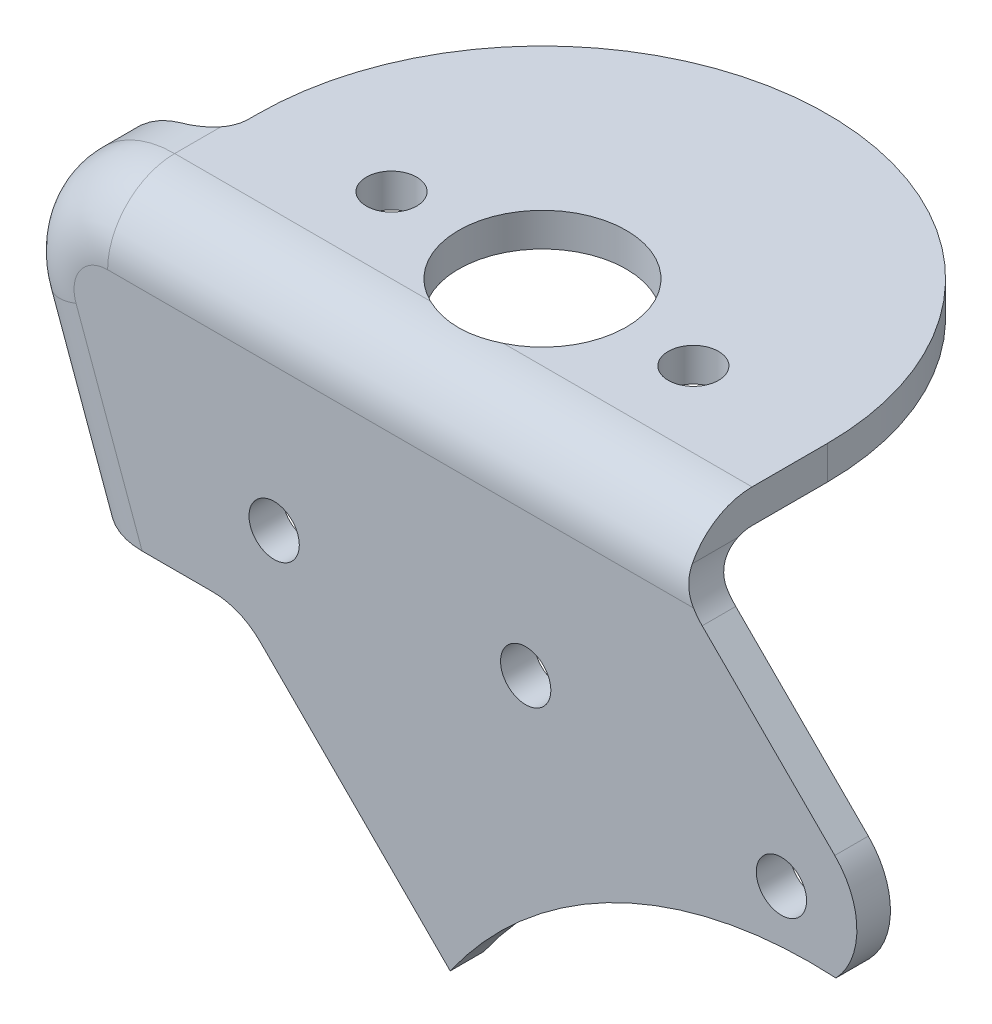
ISO-10303-21;
HEADER;
FILE_DESCRIPTION(('STEP AP214'),'2;1');
FILE_NAME('part.step','',(''),(''),'','','');
FILE_SCHEMA(('AUTOMOTIVE_DESIGN { 1 0 10303 214 1 1 1 1 }'));
ENDSEC;
DATA;
#1=APPLICATION_CONTEXT('core data for automotive mechanical design processes');
#2=APPLICATION_PROTOCOL_DEFINITION('international standard','automotive_design',2000,#1);
#3=PRODUCT_CONTEXT('',#1,'mechanical');
#4=PRODUCT('Part','Part','',(#3));
#5=PRODUCT_RELATED_PRODUCT_CATEGORY('part','',(#4));
#6=PRODUCT_DEFINITION_FORMATION('','',#4);
#7=PRODUCT_DEFINITION_CONTEXT('part definition',#1,'design');
#8=PRODUCT_DEFINITION('design','',#6,#7);
#9=PRODUCT_DEFINITION_SHAPE('','',#8);
#10=(LENGTH_UNIT() NAMED_UNIT(*) SI_UNIT(.MILLI.,.METRE.));
#11=(NAMED_UNIT(*) PLANE_ANGLE_UNIT() SI_UNIT($,.RADIAN.));
#12=(NAMED_UNIT(*) SI_UNIT($,.STERADIAN.) SOLID_ANGLE_UNIT());
#13=UNCERTAINTY_MEASURE_WITH_UNIT(LENGTH_MEASURE(1.E-05),#10,'distance_accuracy_value','');
#14=(GEOMETRIC_REPRESENTATION_CONTEXT(3) GLOBAL_UNCERTAINTY_ASSIGNED_CONTEXT((#13)) GLOBAL_UNIT_ASSIGNED_CONTEXT((#10,
#11,#12)) REPRESENTATION_CONTEXT('',''));
#15=CARTESIAN_POINT('',(0.,0.,0.));
#16=DIRECTION('',(0.,0.,1.));
#17=DIRECTION('',(1.,0.,0.));
#18=AXIS2_PLACEMENT_3D('',#15,#16,#17);
#19=CARTESIAN_POINT('',(45.5,-27.5,13.));
#20=DIRECTION('',(0.,0.,1.));
#21=DIRECTION('',(1.,0.,0.));
#22=AXIS2_PLACEMENT_3D('',#19,#20,#21);
#23=PLANE('',#22);
#24=CARTESIAN_POINT('',(45.5,-27.5,13.));
#25=DIRECTION('',(0.,0.,1.));
#26=DIRECTION('',(1.,0.,0.));
#27=AXIS2_PLACEMENT_3D('',#24,#25,#26);
#28=CIRCLE('',#27,3.);
#29=CARTESIAN_POINT('',(48.5,-27.5,13.));
#30=VERTEX_POINT('',#29);
#31=EDGE_CURVE('E561',#30,#30,#28,.T.);
#32=ORIENTED_EDGE('',*,*,#31,.T.);
#33=EDGE_LOOP('',(#32));
#34=FACE_BOUND('',#33,.T.);
#35=CARTESIAN_POINT('',(15.,-21.,13.));
#36=DIRECTION('',(0.,0.,1.));
#37=DIRECTION('',(1.,0.,0.));
#38=AXIS2_PLACEMENT_3D('',#35,#36,#37);
#39=CIRCLE('',#38,3.);
#40=CARTESIAN_POINT('',(18.,-21.,13.));
#41=VERTEX_POINT('',#40);
#42=EDGE_CURVE('E555',#41,#41,#39,.T.);
#43=ORIENTED_EDGE('',*,*,#42,.T.);
#44=EDGE_LOOP('',(#43));
#45=FACE_BOUND('',#44,.T.);
#46=CARTESIAN_POINT('',(-15.,-21.,13.));
#47=DIRECTION('',(0.,0.,1.));
#48=DIRECTION('',(1.,0.,0.));
#49=AXIS2_PLACEMENT_3D('',#46,#47,#48);
#50=CIRCLE('',#49,3.);
#51=CARTESIAN_POINT('',(-12.,-21.,13.));
#52=VERTEX_POINT('',#51);
#53=EDGE_CURVE('E549',#52,#52,#50,.T.);
#54=ORIENTED_EDGE('',*,*,#53,.T.);
#55=EDGE_LOOP('',(#54));
#56=FACE_BOUND('',#55,.T.);
#57=CARTESIAN_POINT('',(-7.52161055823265,-3.60690930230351,13.));
#58=CARTESIAN_POINT('',(-5.86229170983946,1.79034497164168,13.));
#59=CARTESIAN_POINT('',(-6.41271105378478,0.,7.67314387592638));
#60=CARTESIAN_POINT('',(-7.40224822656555,-3.64360226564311,13.));
#61=CARTESIAN_POINT('',(-5.86298905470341,1.70819566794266,13.));
#62=CARTESIAN_POINT('',(-6.35279946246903,0.,7.72321212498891));
#63=CARTESIAN_POINT('',(-7.28194212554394,-3.67708228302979,13.));
#64=CARTESIAN_POINT('',(-5.85459878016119,1.62497608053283,13.));
#65=CARTESIAN_POINT('',(-6.29064468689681,0.,7.77396719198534));
#66=CARTESIAN_POINT('',(-7.03989687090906,-3.73810383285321,13.));
#67=CARTESIAN_POINT('',(-5.82080115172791,1.4598380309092,13.));
#68=CARTESIAN_POINT('',(-6.16177405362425,0.,7.87650460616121));
#69=CARTESIAN_POINT('',(-6.91815851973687,-3.76564853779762,13.));
#70=CARTESIAN_POINT('',(-5.79570423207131,1.37788758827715,13.));
#71=CARTESIAN_POINT('',(-6.09506065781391,0.,7.92828638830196));
#72=CARTESIAN_POINT('',(-6.55211544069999,-3.83999422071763,13.));
#73=CARTESIAN_POINT('',(-5.69842179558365,1.13895729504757,13.));
#74=CARTESIAN_POINT('',(-5.88834122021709,0.,8.08437943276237));
#75=CARTESIAN_POINT('',(-6.30616478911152,-3.8787495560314,13.));
#76=CARTESIAN_POINT('',(-5.60404047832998,0.983772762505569,13.));
#77=CARTESIAN_POINT('',(-5.74134943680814,0.,8.18978359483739));
#78=CARTESIAN_POINT('',(-5.8133622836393,-3.93857439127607,13.));
#79=CARTESIAN_POINT('',(-5.36677167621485,0.693480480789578,13.));
#80=CARTESIAN_POINT('',(-5.42880539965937,0.,8.40020259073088));
#81=CARTESIAN_POINT('',(-5.56651916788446,-3.95972102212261,13.));
#82=CARTESIAN_POINT('',(-5.2254464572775,0.557498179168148,13.));
#83=CARTESIAN_POINT('',(-5.26333773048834,0.,8.50521709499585));
#84=CARTESIAN_POINT('',(-5.07186613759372,-3.98849883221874,13.));
#85=CARTESIAN_POINT('',(-4.90505767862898,0.307588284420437,13.));
#86=CARTESIAN_POINT('',(-4.91268180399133,0.,8.71246644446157));
#87=CARTESIAN_POINT('',(-4.82405552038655,-3.99611696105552,13.));
#88=CARTESIAN_POINT('',(-4.72668674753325,0.192809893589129,13.));
#89=CARTESIAN_POINT('',(-4.72747468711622,0.,8.81469851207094));
#90=CARTESIAN_POINT('',(-4.25491473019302,-4.00235382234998,13.));
#91=CARTESIAN_POINT('',(-4.28561020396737,-0.0439956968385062,13.));
#92=CARTESIAN_POINT('',(-4.27955709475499,0.,9.04244453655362));
#93=CARTESIAN_POINT('',(-3.93356526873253,-3.99763567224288,13.));
#94=CARTESIAN_POINT('',(-4.01187671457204,-0.160789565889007,13.));
#95=CARTESIAN_POINT('',(-4.01014606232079,0.,9.16587734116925));
#96=CARTESIAN_POINT('',(-3.29107139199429,-3.97951231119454,13.));
#97=CARTESIAN_POINT('',(-3.43086030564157,-0.359090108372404,13.));
#98=CARTESIAN_POINT('',(-3.43956245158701,0.,9.39488349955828));
#99=CARTESIAN_POINT('',(-2.96992709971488,-3.96610382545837,13.));
#100=CARTESIAN_POINT('',(-3.12294311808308,-0.442015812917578,13.));
#101=CARTESIAN_POINT('',(-3.13837793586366,0.,9.50045010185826));
#102=CARTESIAN_POINT('',(-2.32783819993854,-3.93774937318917,13.));
#103=CARTESIAN_POINT('',(-2.48530916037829,-0.577274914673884,13.));
#104=CARTESIAN_POINT('',(-2.50852693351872,0.,9.68580710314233));
#105=CARTESIAN_POINT('',(-2.00689356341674,-3.92280400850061,13.));
#106=CARTESIAN_POINT('',(-2.15409481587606,-0.630636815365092,13.));
#107=CARTESIAN_POINT('',(-2.17987121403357,0.,9.76560754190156));
#108=CARTESIAN_POINT('',(-1.3648887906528,-3.8973176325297,13.));
#109=CARTESIAN_POINT('',(-1.47939060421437,-0.711375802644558,13.));
#110=CARTESIAN_POINT('',(-1.50250473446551,0.,9.89247241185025));
#111=CARTESIAN_POINT('',(-1.04382870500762,-3.88677549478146,13.));
#112=CARTESIAN_POINT('',(-1.13372458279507,-0.739376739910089,13.));
#113=CARTESIAN_POINT('',(-1.1537991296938,0.,9.93954521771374));
#114=CARTESIAN_POINT('',(-0.399987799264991,-3.87388873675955,13.));
#115=CARTESIAN_POINT('',(-0.437117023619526,-0.772650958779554,13.));
#116=CARTESIAN_POINT('',(-0.44530545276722,0.,9.99642394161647));
#117=CARTESIAN_POINT('',(-0.0772060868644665,-3.87158352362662,13.));
#118=CARTESIAN_POINT('',(-0.083522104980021,-0.77807303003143,13.));
#119=CARTESIAN_POINT('',(-0.0854723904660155,0.,10.0060507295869));
#120=CARTESIAN_POINT('',(0.568318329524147,-3.87610963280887,13.));
#121=CARTESIAN_POINT('',(0.618845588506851,-0.766839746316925,13.));
#122=CARTESIAN_POINT('',(0.630949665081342,0.,9.98650925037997));
#123=CARTESIAN_POINT('',(0.891061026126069,-3.882941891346,13.));
#124=CARTESIAN_POINT('',(0.970340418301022,-0.750095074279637,13.));
#125=CARTESIAN_POINT('',(0.987538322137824,0.,9.95733700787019));
#126=CARTESIAN_POINT('',(1.53654185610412,-3.90328300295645,13.));
#127=CARTESIAN_POINT('',(1.66058534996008,-0.693057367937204,13.));
#128=CARTESIAN_POINT('',(1.68559685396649,0.,9.86321668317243));
#129=CARTESIAN_POINT('',(1.85927981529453,-3.91679671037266,13.));
#130=CARTESIAN_POINT('',(2.00178429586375,-0.652305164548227,13.));
#131=CARTESIAN_POINT('',(2.02705553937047,0.,9.7982425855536));
#132=CARTESIAN_POINT('',(2.5046745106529,-3.94538421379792,13.));
#133=CARTESIAN_POINT('',(2.66308649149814,-0.543922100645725,13.));
#134=CARTESIAN_POINT('',(2.6852692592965,0.,9.63868091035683));
#135=CARTESIAN_POINT('',(2.82733124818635,-3.9604579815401,13.));
#136=CARTESIAN_POINT('',(2.98508320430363,-0.475458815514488,13.));
#137=CARTESIAN_POINT('',(3.00202474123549,0.,9.54409386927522));
#138=CARTESIAN_POINT('',(3.35510104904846,-3.98083879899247,13.));
#139=CARTESIAN_POINT('',(3.48487191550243,-0.338851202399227,13.));
#140=CARTESIAN_POINT('',(3.49513665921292,0.,9.37151699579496));
#141=CARTESIAN_POINT('',(3.56014737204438,-3.98770266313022,13.));
#142=CARTESIAN_POINT('',(3.67414960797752,-0.27892552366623,13.));
#143=CARTESIAN_POINT('',(3.68055113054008,0.,9.30006353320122));
#144=CARTESIAN_POINT('',(3.97023832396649,-3.99738155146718,13.));
#145=CARTESIAN_POINT('',(4.03786400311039,-0.145547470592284,13.));
#146=CARTESIAN_POINT('',(4.03828731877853,0.,9.15039806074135));
#147=CARTESIAN_POINT('',(4.17528289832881,-4.000198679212,13.));
#148=CARTESIAN_POINT('',(4.21242929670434,-0.0717159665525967,13.));
#149=CARTESIAN_POINT('',(4.21061579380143,0.,9.07218958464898));
#150=CARTESIAN_POINT('',(4.58514988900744,-3.99977965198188,13.));
#151=CARTESIAN_POINT('',(4.54317538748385,0.0901274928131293,13.));
#152=CARTESIAN_POINT('',(4.54166823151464,0.,8.91106719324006));
#153=CARTESIAN_POINT('',(4.78997227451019,-3.99655080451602,13.));
#154=CARTESIAN_POINT('',(4.69931471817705,0.178567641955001,13.));
#155=CARTESIAN_POINT('',(4.70040837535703,0.,8.82815907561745));
#156=CARTESIAN_POINT('',(5.19956570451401,-3.98194474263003,13.));
#157=CARTESIAN_POINT('',(4.98957750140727,0.369742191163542,13.));
#158=CARTESIAN_POINT('',(5.00468239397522,0.,8.65929966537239));
#159=CARTESIAN_POINT('',(5.40433637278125,-3.97055746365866,13.));
#160=CARTESIAN_POINT('',(5.12338574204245,0.47297082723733,13.));
#161=CARTESIAN_POINT('',(5.15019970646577,0.,8.57334473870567));
#162=CARTESIAN_POINT('',(5.60878905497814,-3.95403633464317,13.));
#163=CARTESIAN_POINT('',(5.24192831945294,0.581909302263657,13.));
#164=CARTESIAN_POINT('',(5.28899230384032,0.,8.48684631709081));
#165=(BOUNDED_SURFACE() B_SPLINE_SURFACE(3,2,((#57,#58,#59),(#60,#61,#62),(#63,#64,#65),(#66,
#67,#68),(#69,#70,#71),(#72,#73,#74),(#75,#76,#77),(#78,#79,#80),(#81,#82,#83),(#84,#85,#86),
(#87,#88,#89),(#90,#91,#92),(#93,#94,#95),(#96,#97,#98),(#99,#100,#101),(#102,#103,#104),(#105,
#106,#107),(#108,#109,#110),(#111,#112,#113),(#114,#115,#116),(#117,#118,#119),(#120,#121,#122),
(#123,#124,#125),(#126,#127,#128),(#129,#130,#131),(#132,#133,#134),(#135,#136,#137),(#138,#139,
#140),(#141,#142,#143),(#144,#145,#146),(#147,#148,#149),(#150,#151,#152),(#153,#154,#155),
(#156,#157,#158),(#159,#160,#161),(#162,#163,#164)),.UNSPECIFIED.,.F.,.F.,
.F.) B_SPLINE_SURFACE_WITH_KNOTS((4,2,2,2,2,2,2,2,2,2,2,2,2,2,2,2,2,4),(3,3),(0.,
0.374513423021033,0.748826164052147,1.49490212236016,2.23769261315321,2.98119925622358,
3.94509151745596,4.90934721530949,5.87322673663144,6.83685951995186,7.8050963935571,
8.77343247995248,9.74247313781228,10.711496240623,11.3269554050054,11.9420945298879,
12.5564906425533,13.1716460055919),(0.,1.),
.UNSPECIFIED.) GEOMETRIC_REPRESENTATION_ITEM() RATIONAL_B_SPLINE_SURFACE(((1.,0.578051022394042,
1.),(1.,0.583464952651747,1.),(1.,0.588876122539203,1.),(1.,0.599659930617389,1.),(1.,
0.605032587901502,1.),(1.,0.621015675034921,1.),(1.,0.631528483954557,1.),(1.,0.652019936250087,
1.),(1.,0.662000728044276,1.),(1.,0.681286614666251,1.),(1.,0.690591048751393,1.),(1.,
0.710941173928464,1.),(1.,0.721685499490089,1.),(1.,0.741253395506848,1.),(1.,0.750076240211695,
1.),(1.,0.76536570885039,1.),(1.,0.771833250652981,1.),(1.,0.782039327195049,1.),(1.,
0.785778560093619,1.),(1.,0.790290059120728,1.),(1.,0.791048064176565,1.),(1.,0.78950247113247,
1.),(1.,0.787198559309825,1.),(1.,0.77968957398,1.),(1.,0.774482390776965,1.),(1.,
0.761496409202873,1.),(1.,0.753717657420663,1.),(1.,0.739236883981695,1.),(1.,0.733177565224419,
1.),(1.,0.720306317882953,1.),(1.,0.713494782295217,1.),(1.,0.699238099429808,1.),(1.,
0.691793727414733,1.),(1.,0.676367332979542,1.),(1.,0.668384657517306,1.),(1.,0.660193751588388,1.))) REPRESENTATION_ITEM('') SURFACE());
#166=CARTESIAN_POINT('',(-7.52161055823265,-3.60690930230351,13.));
#167=CARTESIAN_POINT('',(-7.40224822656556,-3.64360226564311,13.));
#168=CARTESIAN_POINT('',(-7.28194212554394,-3.67708228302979,13.));
#169=CARTESIAN_POINT('',(-7.03989687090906,-3.73810383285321,13.));
#170=CARTESIAN_POINT('',(-6.91815851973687,-3.76564853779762,13.));
#171=CARTESIAN_POINT('',(-6.55211544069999,-3.83999422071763,13.));
#172=CARTESIAN_POINT('',(-6.30616478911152,-3.8787495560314,13.));
#173=CARTESIAN_POINT('',(-5.8133622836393,-3.93857439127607,13.));
#174=CARTESIAN_POINT('',(-5.56651916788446,-3.95972102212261,13.));
#175=CARTESIAN_POINT('',(-5.07186613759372,-3.98849883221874,13.));
#176=CARTESIAN_POINT('',(-4.82405552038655,-3.99611696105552,13.));
#177=CARTESIAN_POINT('',(-4.25491473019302,-4.00235382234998,13.));
#178=CARTESIAN_POINT('',(-3.93356526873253,-3.99763567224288,13.));
#179=CARTESIAN_POINT('',(-3.29107139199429,-3.97951231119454,13.));
#180=CARTESIAN_POINT('',(-2.96992709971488,-3.96610382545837,13.));
#181=CARTESIAN_POINT('',(-2.32783819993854,-3.93774937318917,13.));
#182=CARTESIAN_POINT('',(-2.00689356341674,-3.92280400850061,13.));
#183=CARTESIAN_POINT('',(-1.3648887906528,-3.8973176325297,13.));
#184=CARTESIAN_POINT('',(-1.04382870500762,-3.88677549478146,13.));
#185=CARTESIAN_POINT('',(-0.399987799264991,-3.87388873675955,13.));
#186=CARTESIAN_POINT('',(-0.0772060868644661,-3.87158352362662,13.));
#187=CARTESIAN_POINT('',(0.568318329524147,-3.87610963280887,13.));
#188=CARTESIAN_POINT('',(0.891061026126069,-3.882941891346,13.));
#189=CARTESIAN_POINT('',(1.53654185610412,-3.90328300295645,13.));
#190=CARTESIAN_POINT('',(1.85927981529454,-3.91679671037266,13.));
#191=CARTESIAN_POINT('',(2.5046745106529,-3.94538421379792,13.));
#192=CARTESIAN_POINT('',(2.82733124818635,-3.9604579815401,13.));
#193=CARTESIAN_POINT('',(3.35510104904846,-3.98083879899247,13.));
#194=CARTESIAN_POINT('',(3.56014737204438,-3.98770266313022,13.));
#195=CARTESIAN_POINT('',(3.97023832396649,-3.99738155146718,13.));
#196=CARTESIAN_POINT('',(4.17528289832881,-4.000198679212,13.));
#197=CARTESIAN_POINT('',(4.58514988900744,-3.99977965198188,13.));
#198=CARTESIAN_POINT('',(4.78997227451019,-3.99655080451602,13.));
#199=CARTESIAN_POINT('',(5.19956570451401,-3.98194474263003,13.));
#200=CARTESIAN_POINT('',(5.40433637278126,-3.97055746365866,13.));
#201=CARTESIAN_POINT('',(5.60878905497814,-3.95403633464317,13.));
#202=B_SPLINE_CURVE_WITH_KNOTS('',3,(#166,#167,#168,#169,#170,#171,#172,#173,#174,#175,#176,
#177,#178,#179,#180,#181,#182,#183,#184,#185,#186,#187,#188,#189,#190,#191,#192,#193,#194,#195,
#196,#197,#198,#199,#200,#201),.UNSPECIFIED.,.F.,.F.,(4,2,2,2,2,2,2,2,2,2,2,2,2,2,2,2,2,4),(0.,
0.374513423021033,0.748826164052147,1.49490212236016,2.23769261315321,2.98119925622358,
3.94509151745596,4.90934721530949,5.87322673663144,6.83685951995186,7.8050963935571,
8.77343247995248,9.74247313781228,10.711496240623,11.3269554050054,11.9420945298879,
12.5564906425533,13.1716460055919),.UNSPECIFIED.);
#203=CARTESIAN_POINT('',(-4.35889894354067,-4.,13.));
#204=VERTEX_POINT('',#203);
#205=CARTESIAN_POINT('',(4.35889894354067,-4.,13.));
#206=VERTEX_POINT('',#205);
#207=EDGE_CURVE('E337',#204,#206,#202,.T.);
#208=ORIENTED_EDGE('',*,*,#207,.T.);
#209=DIRECTION('',(1.,0.,0.));
#210=VECTOR('',#209,1.);
#211=CARTESIAN_POINT('',(34.,-4.,13.));
#212=LINE('',#211,#210);
#213=CARTESIAN_POINT('',(35.0131940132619,-4.,13.));
#214=VERTEX_POINT('',#213);
#215=EDGE_CURVE('E343',#206,#214,#212,.T.);
#216=ORIENTED_EDGE('',*,*,#215,.T.);
#217=CARTESIAN_POINT('',(41.,-0.372583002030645,13.));
#218=DIRECTION('',(0.,0.,1.));
#219=DIRECTION('',(1.,0.,0.));
#220=AXIS2_PLACEMENT_3D('',#217,#218,#219);
#221=CIRCLE('',#220,7.);
#222=CARTESIAN_POINT('',(36.0502525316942,-5.32233047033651,13.));
#223=VERTEX_POINT('',#222);
#224=EDGE_CURVE('E328',#214,#223,#221,.T.);
#225=ORIENTED_EDGE('',*,*,#224,.T.);
#226=DIRECTION('',(-0.707106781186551,0.707106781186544,0.));
#227=VECTOR('',#226,1.);
#228=CARTESIAN_POINT('',(34.,-3.27207793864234,13.));
#229=LINE('',#228,#227);
#230=CARTESIAN_POINT('',(51.8639610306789,-21.136038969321,13.));
#231=VERTEX_POINT('',#230);
#232=EDGE_CURVE('E254',#231,#223,#229,.T.);
#233=ORIENTED_EDGE('',*,*,#232,.F.);
#234=CARTESIAN_POINT('',(45.5,-27.5,13.));
#235=DIRECTION('',(0.,0.,1.));
#236=DIRECTION('',(1.,0.,0.));
#237=AXIS2_PLACEMENT_3D('',#234,#235,#236);
#238=CIRCLE('',#237,9.);
#239=CARTESIAN_POINT('',(52.,-33.7249497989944,13.));
#240=VERTEX_POINT('',#239);
#241=EDGE_CURVE('E251',#240,#231,#238,.T.);
#242=ORIENTED_EDGE('',*,*,#241,.F.);
#243=CARTESIAN_POINT('',(48.9874862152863,-86.1384476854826,13.));
#244=DIRECTION('',(0.,0.,-1.));
#245=DIRECTION('',(1.,0.,0.));
#246=AXIS2_PLACEMENT_3D('',#243,#244,#245);
#247=CIRCLE('',#246,52.5);
#248=CARTESIAN_POINT('',(6.,-56.,13.));
#249=VERTEX_POINT('',#248);
#250=EDGE_CURVE('E261',#249,#240,#247,.T.);
#251=ORIENTED_EDGE('',*,*,#250,.F.);
#252=DIRECTION('',(0.707106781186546,-0.707106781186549,0.));
#253=VECTOR('',#252,1.);
#254=CARTESIAN_POINT('',(6.00000000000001,-56.,13.));
#255=LINE('',#254,#253);
#256=CARTESIAN_POINT('',(-16.6568542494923,-33.3431457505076,13.));
#257=VERTEX_POINT('',#256);
#258=EDGE_CURVE('E259',#257,#249,#255,.T.);
#259=ORIENTED_EDGE('',*,*,#258,.F.);
#260=CARTESIAN_POINT('',(-22.3137084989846,-39.,13.));
#261=DIRECTION('',(0.,0.,1.));
#262=DIRECTION('',(1.,0.,0.));
#263=AXIS2_PLACEMENT_3D('',#260,#261,#262);
#264=CIRCLE('',#263,8.);
#265=CARTESIAN_POINT('',(-22.3137084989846,-31.,13.));
#266=VERTEX_POINT('',#265);
#267=EDGE_CURVE('E11',#257,#266,#264,.T.);
#268=ORIENTED_EDGE('',*,*,#267,.T.);
#269=DIRECTION('',(1.,0.,0.));
#270=VECTOR('',#269,1.);
#271=CARTESIAN_POINT('',(-18.9999999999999,-31.,13.));
#272=LINE('',#271,#270);
#273=CARTESIAN_POINT('',(-30.7476196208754,-31.,13.));
#274=VERTEX_POINT('',#273);
#275=EDGE_CURVE('E257',#274,#266,#272,.T.);
#276=ORIENTED_EDGE('',*,*,#275,.F.);
#277=DIRECTION('',(0.342020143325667,-0.939692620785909,0.));
#278=VECTOR('',#277,1.);
#279=CARTESIAN_POINT('',(-38.620994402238,-9.36808057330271,13.));
#280=LINE('',#279,#278);
#281=CARTESIAN_POINT('',(-38.6209944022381,-9.36808057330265,13.));
#282=VERTEX_POINT('',#281);
#283=EDGE_CURVE('E330',#274,#282,#280,.F.);
#284=ORIENTED_EDGE('',*,*,#283,.T.);
#285=CARTESIAN_POINT('',(-34.8622239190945,-8.,13.));
#286=DIRECTION('',(0.,0.,1.));
#287=DIRECTION('',(1.,0.,0.));
#288=AXIS2_PLACEMENT_3D('',#285,#286,#287);
#289=CIRCLE('',#288,3.99999999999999);
#290=CARTESIAN_POINT('',(-34.8622239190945,-4.00000000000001,13.));
#291=VERTEX_POINT('',#290);
#292=EDGE_CURVE('E332',#282,#291,#289,.F.);
#293=ORIENTED_EDGE('',*,*,#292,.T.);
#294=DIRECTION('',(1.,0.,0.));
#295=VECTOR('',#294,1.);
#296=CARTESIAN_POINT('',(34.,-4.,13.));
#297=LINE('',#296,#295);
#298=EDGE_CURVE('E334',#291,#204,#297,.T.);
#299=ORIENTED_EDGE('',*,*,#298,.T.);
#300=EDGE_LOOP('',(#208,#216,#225,#233,#242,#251,#259,#268,#276,#284,#293,#299));
#301=FACE_BOUND('',#300,.T.);
#302=ADVANCED_FACE('F31',(#34,#45,#56,#301),#23,.F.);
#303=CARTESIAN_POINT('',(0.,0.,0.));
#304=DIRECTION('',(0.,1.,0.));
#305=DIRECTION('',(0.,0.,1.));
#306=AXIS2_PLACEMENT_3D('',#303,#304,#305);
#307=PLANE('',#306);
#308=CARTESIAN_POINT('',(18.,0.,0.));
#309=DIRECTION('',(0.,1.,0.));
#310=DIRECTION('',(0.,0.,1.));
#311=AXIS2_PLACEMENT_3D('',#308,#309,#310);
#312=CIRCLE('',#311,3.);
#313=CARTESIAN_POINT('',(18.,0.,3.));
#314=VERTEX_POINT('',#313);
#315=EDGE_CURVE('E267',#314,#314,#312,.T.);
#316=ORIENTED_EDGE('',*,*,#315,.T.);
#317=EDGE_LOOP('',(#316));
#318=FACE_BOUND('',#317,.T.);
#319=DIRECTION('',(0.,0.,-1.));
#320=VECTOR('',#319,1.);
#321=CARTESIAN_POINT('',(34.,0.,0.));
#322=LINE('',#321,#320);
#323=CARTESIAN_POINT('',(34.,0.,9.));
#324=VERTEX_POINT('',#323);
#325=CARTESIAN_POINT('',(34.,0.,0.));
#326=VERTEX_POINT('',#325);
#327=EDGE_CURVE('E299',#324,#326,#322,.T.);
#328=ORIENTED_EDGE('',*,*,#327,.F.);
#329=DIRECTION('',(1.,0.,0.));
#330=VECTOR('',#329,1.);
#331=CARTESIAN_POINT('',(-34.8622239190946,0.,9.));
#332=LINE('',#331,#330);
#333=CARTESIAN_POINT('',(4.35889894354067,0.,9.));
#334=VERTEX_POINT('',#333);
#335=EDGE_CURVE('E608',#324,#334,#332,.F.);
#336=ORIENTED_EDGE('',*,*,#335,.T.);
#337=CARTESIAN_POINT('',(0.,0.,0.));
#338=DIRECTION('',(0.,1.,0.));
#339=DIRECTION('',(0.,0.,1.));
#340=AXIS2_PLACEMENT_3D('',#337,#338,#339);
#341=CIRCLE('',#340,10.);
#342=CARTESIAN_POINT('',(-4.35889894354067,0.,9.));
#343=VERTEX_POINT('',#342);
#344=EDGE_CURVE('E287',#334,#343,#341,.T.);
#345=ORIENTED_EDGE('',*,*,#344,.T.);
#346=DIRECTION('',(1.,0.,0.));
#347=VECTOR('',#346,1.);
#348=CARTESIAN_POINT('',(-34.8622239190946,0.,9.));
#349=LINE('',#348,#347);
#350=CARTESIAN_POINT('',(-34.8622239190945,0.,9.));
#351=VERTEX_POINT('',#350);
#352=EDGE_CURVE('E534',#343,#351,#349,.F.);
#353=ORIENTED_EDGE('',*,*,#352,.T.);
#354=DIRECTION('',(0.,0.,1.));
#355=VECTOR('',#354,1.);
#356=CARTESIAN_POINT('',(-34.8622239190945,0.,5.));
#357=LINE('',#356,#355);
#358=CARTESIAN_POINT('',(-34.8622239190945,0.,3.4807985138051));
#359=VERTEX_POINT('',#358);
#360=EDGE_CURVE('E221',#359,#351,#357,.T.);
#361=ORIENTED_EDGE('',*,*,#360,.F.);
#362=CARTESIAN_POINT('',(-38.,0.,1.));
#363=DIRECTION('',(0.,1.,0.));
#364=DIRECTION('',(0.,0.,1.));
#365=AXIS2_PLACEMENT_3D('',#362,#363,#364);
#366=CIRCLE('',#365,4.);
#367=CARTESIAN_POINT('',(-34.,0.,1.));
#368=VERTEX_POINT('',#367);
#369=EDGE_CURVE('E484',#359,#368,#366,.T.);
#370=ORIENTED_EDGE('',*,*,#369,.T.);
#371=DIRECTION('',(0.,0.,1.));
#372=VECTOR('',#371,1.);
#373=CARTESIAN_POINT('',(-34.,0.,0.));
#374=LINE('',#373,#372);
#375=CARTESIAN_POINT('',(-34.,0.,0.));
#376=VERTEX_POINT('',#375);
#377=EDGE_CURVE('E296',#376,#368,#374,.T.);
#378=ORIENTED_EDGE('',*,*,#377,.F.);
#379=CARTESIAN_POINT('',(0.,0.,0.));
#380=DIRECTION('',(0.,1.,0.));
#381=DIRECTION('',(0.,0.,1.));
#382=AXIS2_PLACEMENT_3D('',#379,#380,#381);
#383=CIRCLE('',#382,34.);
#384=EDGE_CURVE('E293',#326,#376,#383,.T.);
#385=ORIENTED_EDGE('',*,*,#384,.F.);
#386=EDGE_LOOP('',(#328,#336,#345,#353,#361,#370,#378,#385));
#387=FACE_BOUND('',#386,.T.);
#388=CARTESIAN_POINT('',(-18.,0.,0.));
#389=DIRECTION('',(0.,1.,0.));
#390=DIRECTION('',(0.,0.,1.));
#391=AXIS2_PLACEMENT_3D('',#388,#389,#390);
#392=CIRCLE('',#391,3.);
#393=CARTESIAN_POINT('',(-18.,0.,3.));
#394=VERTEX_POINT('',#393);
#395=EDGE_CURVE('E280',#394,#394,#392,.T.);
#396=ORIENTED_EDGE('',*,*,#395,.T.);
#397=EDGE_LOOP('',(#396));
#398=FACE_BOUND('',#397,.T.);
#399=ADVANCED_FACE('F349',(#318,#387,#398),#307,.F.);
#400=CARTESIAN_POINT('',(-34.,4.,0.));
#401=DIRECTION('',(1.,0.,0.));
#402=DIRECTION('',(0.,0.,-1.));
#403=AXIS2_PLACEMENT_3D('',#400,#401,#402);
#404=PLANE('',#403);
#405=ORIENTED_EDGE('',*,*,#377,.T.);
#406=DIRECTION('',(0.,-1.,0.));
#407=VECTOR('',#406,1.);
#408=CARTESIAN_POINT('',(-34.,4.,1.));
#409=LINE('',#408,#407);
#410=CARTESIAN_POINT('',(-34.,4.,1.));
#411=VERTEX_POINT('',#410);
#412=EDGE_CURVE('E486',#368,#411,#409,.F.);
#413=ORIENTED_EDGE('',*,*,#412,.T.);
#414=DIRECTION('',(0.,0.,1.));
#415=VECTOR('',#414,1.);
#416=CARTESIAN_POINT('',(-34.,4.,0.));
#417=LINE('',#416,#415);
#418=CARTESIAN_POINT('',(-34.,4.,0.));
#419=VERTEX_POINT('',#418);
#420=EDGE_CURVE('E304',#419,#411,#417,.T.);
#421=ORIENTED_EDGE('',*,*,#420,.F.);
#422=DIRECTION('',(0.,-1.,0.));
#423=VECTOR('',#422,1.);
#424=CARTESIAN_POINT('',(-34.,4.,0.));
#425=LINE('',#424,#423);
#426=EDGE_CURVE('E312',#419,#376,#425,.T.);
#427=ORIENTED_EDGE('',*,*,#426,.T.);
#428=EDGE_LOOP('',(#405,#413,#421,#427));
#429=FACE_BOUND('',#428,.T.);
#430=ADVANCED_FACE('F455',(#429),#404,.F.);
#431=CARTESIAN_POINT('',(0.,4.,0.));
#432=DIRECTION('',(0.,1.,0.));
#433=DIRECTION('',(0.,0.,1.));
#434=AXIS2_PLACEMENT_3D('',#431,#432,#433);
#435=PLANE('',#434);
#436=CARTESIAN_POINT('',(18.,4.,0.));
#437=DIRECTION('',(0.,1.,0.));
#438=DIRECTION('',(0.,0.,1.));
#439=AXIS2_PLACEMENT_3D('',#436,#437,#438);
#440=CIRCLE('',#439,3.);
#441=CARTESIAN_POINT('',(18.,4.,3.));
#442=VERTEX_POINT('',#441);
#443=EDGE_CURVE('E277',#442,#442,#440,.T.);
#444=ORIENTED_EDGE('',*,*,#443,.F.);
#445=EDGE_LOOP('',(#444));
#446=FACE_BOUND('',#445,.T.);
#447=DIRECTION('',(0.,0.,1.));
#448=VECTOR('',#447,1.);
#449=CARTESIAN_POINT('',(-34.8622239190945,4.,0.));
#450=LINE('',#449,#448);
#451=CARTESIAN_POINT('',(-34.8622239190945,4.,3.4807985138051));
#452=VERTEX_POINT('',#451);
#453=CARTESIAN_POINT('',(-34.8622239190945,4.,9.));
#454=VERTEX_POINT('',#453);
#455=EDGE_CURVE('E315',#452,#454,#450,.T.);
#456=ORIENTED_EDGE('',*,*,#455,.T.);
#457=DIRECTION('',(1.,0.,0.));
#458=VECTOR('',#457,1.);
#459=CARTESIAN_POINT('',(34.,4.,9.));
#460=LINE('',#459,#458);
#461=CARTESIAN_POINT('',(-4.35889894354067,4.,9.));
#462=VERTEX_POINT('',#461);
#463=EDGE_CURVE('E441',#454,#462,#460,.T.);
#464=ORIENTED_EDGE('',*,*,#463,.T.);
#465=CARTESIAN_POINT('',(0.,4.,0.));
#466=DIRECTION('',(0.,1.,0.));
#467=DIRECTION('',(0.,0.,1.));
#468=AXIS2_PLACEMENT_3D('',#465,#466,#467);
#469=CIRCLE('',#468,10.);
#470=CARTESIAN_POINT('',(4.35889894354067,4.,9.));
#471=VERTEX_POINT('',#470);
#472=EDGE_CURVE('E290',#471,#462,#469,.T.);
#473=ORIENTED_EDGE('',*,*,#472,.F.);
#474=DIRECTION('',(1.,0.,0.));
#475=VECTOR('',#474,1.);
#476=CARTESIAN_POINT('',(34.,4.,9.));
#477=LINE('',#476,#475);
#478=CARTESIAN_POINT('',(34.,4.,9.));
#479=VERTEX_POINT('',#478);
#480=EDGE_CURVE('E494',#471,#479,#477,.T.);
#481=ORIENTED_EDGE('',*,*,#480,.T.);
#482=DIRECTION('',(0.,0.,-1.));
#483=VECTOR('',#482,1.);
#484=CARTESIAN_POINT('',(34.,4.,0.));
#485=LINE('',#484,#483);
#486=CARTESIAN_POINT('',(34.,4.,0.));
#487=VERTEX_POINT('',#486);
#488=EDGE_CURVE('E307',#479,#487,#485,.T.);
#489=ORIENTED_EDGE('',*,*,#488,.T.);
#490=CARTESIAN_POINT('',(0.,4.,0.));
#491=DIRECTION('',(0.,1.,0.));
#492=DIRECTION('',(0.,0.,1.));
#493=AXIS2_PLACEMENT_3D('',#490,#491,#492);
#494=CIRCLE('',#493,34.);
#495=EDGE_CURVE('E301',#487,#419,#494,.T.);
#496=ORIENTED_EDGE('',*,*,#495,.T.);
#497=ORIENTED_EDGE('',*,*,#420,.T.);
#498=CARTESIAN_POINT('',(-38.,4.,1.));
#499=DIRECTION('',(0.,1.,0.));
#500=DIRECTION('',(0.,0.,1.));
#501=AXIS2_PLACEMENT_3D('',#498,#499,#500);
#502=CIRCLE('',#501,4.);
#503=EDGE_CURVE('E500',#411,#452,#502,.F.);
#504=ORIENTED_EDGE('',*,*,#503,.T.);
#505=EDGE_LOOP('',(#456,#464,#473,#481,#489,#496,#497,#504));
#506=FACE_BOUND('',#505,.T.);
#507=CARTESIAN_POINT('',(-18.,4.,0.));
#508=DIRECTION('',(0.,1.,0.));
#509=DIRECTION('',(0.,0.,1.));
#510=AXIS2_PLACEMENT_3D('',#507,#508,#509);
#511=CIRCLE('',#510,3.);
#512=CARTESIAN_POINT('',(-18.,4.,3.));
#513=VERTEX_POINT('',#512);
#514=EDGE_CURVE('E283',#513,#513,#511,.T.);
#515=ORIENTED_EDGE('',*,*,#514,.F.);
#516=EDGE_LOOP('',(#515));
#517=FACE_BOUND('',#516,.T.);
#518=ADVANCED_FACE('F457',(#446,#506,#517),#435,.T.);
#519=CARTESIAN_POINT('',(0.,4.,0.));
#520=DIRECTION('',(0.,-1.,0.));
#521=DIRECTION('',(0.,0.,-1.));
#522=AXIS2_PLACEMENT_3D('',#519,#520,#521);
#523=CYLINDRICAL_SURFACE('',#522,34.);
#524=ORIENTED_EDGE('',*,*,#384,.T.);
#525=ORIENTED_EDGE('',*,*,#426,.F.);
#526=ORIENTED_EDGE('',*,*,#495,.F.);
#527=DIRECTION('',(0.,-1.,0.));
#528=VECTOR('',#527,1.);
#529=CARTESIAN_POINT('',(34.,4.,0.));
#530=LINE('',#529,#528);
#531=EDGE_CURVE('E309',#487,#326,#530,.T.);
#532=ORIENTED_EDGE('',*,*,#531,.T.);
#533=EDGE_LOOP('',(#524,#525,#526,#532));
#534=FACE_BOUND('',#533,.T.);
#535=ADVANCED_FACE('F460',(#534),#523,.T.);
#536=CARTESIAN_POINT('',(-34.,4.,17.));
#537=DIRECTION('',(0.,0.,-1.));
#538=DIRECTION('',(-1.,0.,0.));
#539=AXIS2_PLACEMENT_3D('',#536,#537,#538);
#540=PLANE('',#539);
#541=CARTESIAN_POINT('',(45.5,-27.5,17.));
#542=DIRECTION('',(0.,0.,1.));
#543=DIRECTION('',(1.,0.,0.));
#544=AXIS2_PLACEMENT_3D('',#541,#542,#543);
#545=CIRCLE('',#544,3.);
#546=CARTESIAN_POINT('',(48.5,-27.5,17.));
#547=VERTEX_POINT('',#546);
#548=EDGE_CURVE('E564',#547,#547,#545,.T.);
#549=ORIENTED_EDGE('',*,*,#548,.F.);
#550=EDGE_LOOP('',(#549));
#551=FACE_BOUND('',#550,.T.);
#552=CARTESIAN_POINT('',(15.,-21.,17.));
#553=DIRECTION('',(0.,0.,1.));
#554=DIRECTION('',(1.,0.,0.));
#555=AXIS2_PLACEMENT_3D('',#552,#553,#554);
#556=CIRCLE('',#555,3.);
#557=CARTESIAN_POINT('',(18.,-21.,17.));
#558=VERTEX_POINT('',#557);
#559=EDGE_CURVE('E558',#558,#558,#556,.T.);
#560=ORIENTED_EDGE('',*,*,#559,.F.);
#561=EDGE_LOOP('',(#560));
#562=FACE_BOUND('',#561,.T.);
#563=CARTESIAN_POINT('',(-15.,-21.,17.));
#564=DIRECTION('',(0.,0.,1.));
#565=DIRECTION('',(1.,0.,0.));
#566=AXIS2_PLACEMENT_3D('',#563,#564,#565);
#567=CIRCLE('',#566,3.);
#568=CARTESIAN_POINT('',(-12.,-21.,17.));
#569=VERTEX_POINT('',#568);
#570=EDGE_CURVE('E552',#569,#569,#567,.T.);
#571=ORIENTED_EDGE('',*,*,#570,.F.);
#572=EDGE_LOOP('',(#571));
#573=FACE_BOUND('',#572,.T.);
#574=CARTESIAN_POINT('',(41.,-0.372583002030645,17.));
#575=DIRECTION('',(0.,0.,-1.));
#576=DIRECTION('',(-1.,0.,0.));
#577=AXIS2_PLACEMENT_3D('',#574,#575,#576);
#578=CIRCLE('',#577,7.);
#579=CARTESIAN_POINT('',(36.0502525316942,-5.32233047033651,17.));
#580=VERTEX_POINT('',#579);
#581=CARTESIAN_POINT('',(35.0131940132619,-4.,17.));
#582=VERTEX_POINT('',#581);
#583=EDGE_CURVE('E325',#580,#582,#578,.T.);
#584=ORIENTED_EDGE('',*,*,#583,.T.);
#585=DIRECTION('',(1.,0.,0.));
#586=VECTOR('',#585,1.);
#587=CARTESIAN_POINT('',(-34.8622239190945,-4.,17.));
#588=LINE('',#587,#586);
#589=CARTESIAN_POINT('',(-34.8622239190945,-4.,17.));
#590=VERTEX_POINT('',#589);
#591=EDGE_CURVE('E575',#582,#590,#588,.F.);
#592=ORIENTED_EDGE('',*,*,#591,.T.);
#593=CARTESIAN_POINT('',(-34.8622239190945,-8.,17.));
#594=DIRECTION('',(0.,0.,-1.));
#595=DIRECTION('',(-1.,0.,0.));
#596=AXIS2_PLACEMENT_3D('',#593,#594,#595);
#597=CIRCLE('',#596,4.);
#598=CARTESIAN_POINT('',(-38.6209944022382,-9.36808057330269,17.));
#599=VERTEX_POINT('',#598);
#600=EDGE_CURVE('E579',#590,#599,#597,.F.);
#601=ORIENTED_EDGE('',*,*,#600,.T.);
#602=DIRECTION('',(0.342020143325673,-0.939692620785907,0.));
#603=VECTOR('',#602,1.);
#604=CARTESIAN_POINT('',(-31.7435008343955,-28.2638388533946,17.));
#605=LINE('',#604,#603);
#606=CARTESIAN_POINT('',(-30.7476196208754,-31.,17.));
#607=VERTEX_POINT('',#606);
#608=EDGE_CURVE('E421',#599,#607,#605,.T.);
#609=ORIENTED_EDGE('',*,*,#608,.T.);
#610=DIRECTION('',(1.,0.,0.));
#611=VECTOR('',#610,1.);
#612=CARTESIAN_POINT('',(-18.9999999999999,-31.,17.));
#613=LINE('',#612,#611);
#614=CARTESIAN_POINT('',(-22.3137084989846,-31.,17.));
#615=VERTEX_POINT('',#614);
#616=EDGE_CURVE('E243',#607,#615,#613,.T.);
#617=ORIENTED_EDGE('',*,*,#616,.T.);
#618=CARTESIAN_POINT('',(-22.3137084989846,-39.,17.));
#619=DIRECTION('',(0.,0.,-1.));
#620=DIRECTION('',(-1.,0.,0.));
#621=AXIS2_PLACEMENT_3D('',#618,#619,#620);
#622=CIRCLE('',#621,8.);
#623=CARTESIAN_POINT('',(-16.6568542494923,-33.3431457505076,17.));
#624=VERTEX_POINT('',#623);
#625=EDGE_CURVE('E40',#615,#624,#622,.T.);
#626=ORIENTED_EDGE('',*,*,#625,.T.);
#627=DIRECTION('',(0.707106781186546,-0.707106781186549,0.));
#628=VECTOR('',#627,1.);
#629=CARTESIAN_POINT('',(6.00000000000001,-56.,17.));
#630=LINE('',#629,#628);
#631=CARTESIAN_POINT('',(6.,-56.,17.));
#632=VERTEX_POINT('',#631);
#633=EDGE_CURVE('E246',#624,#632,#630,.T.);
#634=ORIENTED_EDGE('',*,*,#633,.T.);
#635=CARTESIAN_POINT('',(48.9874862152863,-86.1384476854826,17.));
#636=DIRECTION('',(0.,0.,-1.));
#637=DIRECTION('',(1.,0.,0.));
#638=AXIS2_PLACEMENT_3D('',#635,#636,#637);
#639=CIRCLE('',#638,52.5);
#640=CARTESIAN_POINT('',(52.,-33.7249497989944,17.));
#641=VERTEX_POINT('',#640);
#642=EDGE_CURVE('E248',#632,#641,#639,.T.);
#643=ORIENTED_EDGE('',*,*,#642,.T.);
#644=CARTESIAN_POINT('',(45.5,-27.5,17.));
#645=DIRECTION('',(0.,0.,1.));
#646=DIRECTION('',(1.,0.,0.));
#647=AXIS2_PLACEMENT_3D('',#644,#645,#646);
#648=CIRCLE('',#647,9.);
#649=CARTESIAN_POINT('',(51.8639610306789,-21.136038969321,17.));
#650=VERTEX_POINT('',#649);
#651=EDGE_CURVE('E237',#641,#650,#648,.T.);
#652=ORIENTED_EDGE('',*,*,#651,.T.);
#653=DIRECTION('',(-0.707106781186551,0.707106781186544,0.));
#654=VECTOR('',#653,1.);
#655=CARTESIAN_POINT('',(34.,-3.27207793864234,17.));
#656=LINE('',#655,#654);
#657=EDGE_CURVE('E240',#650,#580,#656,.T.);
#658=ORIENTED_EDGE('',*,*,#657,.T.);
#659=EDGE_LOOP('',(#584,#592,#601,#609,#617,#626,#634,#643,#652,#658));
#660=FACE_BOUND('',#659,.T.);
#661=ADVANCED_FACE('F464',(#551,#562,#573,#660),#540,.F.);
#662=CARTESIAN_POINT('',(34.,4.,0.));
#663=DIRECTION('',(-1.,0.,0.));
#664=DIRECTION('',(0.,0.,1.));
#665=AXIS2_PLACEMENT_3D('',#662,#663,#664);
#666=PLANE('',#665);
#667=ORIENTED_EDGE('',*,*,#488,.F.);
#668=CARTESIAN_POINT('',(34.,-4.,9.));
#669=DIRECTION('',(-1.,0.,0.));
#670=DIRECTION('',(0.,0.,1.));
#671=AXIS2_PLACEMENT_3D('',#668,#669,#670);
#672=CIRCLE('',#671,8.);
#673=CARTESIAN_POINT('',(34.,-0.372583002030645,16.1303468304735));
#674=VERTEX_POINT('',#673);
#675=EDGE_CURVE('E422',#479,#674,#672,.F.);
#676=ORIENTED_EDGE('',*,*,#675,.T.);
#677=DIRECTION('',(0.,0.,1.));
#678=VECTOR('',#677,1.);
#679=CARTESIAN_POINT('',(34.,-0.372583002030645,0.));
#680=LINE('',#679,#678);
#681=CARTESIAN_POINT('',(34.,-0.372583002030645,10.6857775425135));
#682=VERTEX_POINT('',#681);
#683=EDGE_CURVE('E323',#674,#682,#680,.F.);
#684=ORIENTED_EDGE('',*,*,#683,.T.);
#685=CARTESIAN_POINT('',(34.,-4.,9.));
#686=DIRECTION('',(-1.,0.,0.));
#687=DIRECTION('',(0.,0.,1.));
#688=AXIS2_PLACEMENT_3D('',#685,#686,#687);
#689=CIRCLE('',#688,4.);
#690=EDGE_CURVE('E402',#682,#324,#689,.T.);
#691=ORIENTED_EDGE('',*,*,#690,.T.);
#692=ORIENTED_EDGE('',*,*,#327,.T.);
#693=ORIENTED_EDGE('',*,*,#531,.F.);
#694=EDGE_LOOP('',(#667,#676,#684,#691,#692,#693));
#695=FACE_BOUND('',#694,.T.);
#696=ADVANCED_FACE('F448',(#695),#666,.F.);
#697=CARTESIAN_POINT('',(0.,4.,0.));
#698=DIRECTION('',(0.,-1.,0.));
#699=DIRECTION('',(0.,0.,-1.));
#700=AXIS2_PLACEMENT_3D('',#697,#698,#699);
#701=CYLINDRICAL_SURFACE('',#700,10.);
#702=ORIENTED_EDGE('',*,*,#472,.T.);
#703=CARTESIAN_POINT('',(-4.35889894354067,4.,9.));
#704=CARTESIAN_POINT('',(-4.23253167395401,3.99999656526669,9.06120247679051));
#705=CARTESIAN_POINT('',(-4.10489313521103,3.99929815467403,9.11973441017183));
#706=CARTESIAN_POINT('',(-3.84727782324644,3.9968490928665,9.23136847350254));
#707=CARTESIAN_POINT('',(-3.71730112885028,3.99509847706,9.28447078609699));
#708=CARTESIAN_POINT('',(-3.32422898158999,3.98877591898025,9.43547862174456));
#709=CARTESIAN_POINT('',(-3.05792217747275,3.98313289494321,9.52511858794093));
#710=CARTESIAN_POINT('',(-2.51897697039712,3.97129659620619,9.68160408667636));
#711=CARTESIAN_POINT('',(-2.2463438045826,3.96510376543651,9.74846780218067));
#712=CARTESIAN_POINT('',(-1.69639552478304,3.95393773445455,9.85905133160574));
#713=CARTESIAN_POINT('',(-1.41908056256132,3.9489644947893,9.9027718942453));
#714=CARTESIAN_POINT('',(-0.861468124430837,3.94143434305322,9.96678013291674));
#715=CARTESIAN_POINT('',(-0.581168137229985,3.93887966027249,9.9870461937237));
#716=CARTESIAN_POINT('',(-0.0198247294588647,3.93676350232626,10.0039219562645));
#717=CARTESIAN_POINT('',(0.261218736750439,3.9372022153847,10.0005301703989));
#718=CARTESIAN_POINT('',(0.82178630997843,3.94097510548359,9.97012580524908));
#719=CARTESIAN_POINT('',(1.10131139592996,3.94430711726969,9.94313088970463));
#720=CARTESIAN_POINT('',(1.65703098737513,3.9531130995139,9.86574457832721));
#721=CARTESIAN_POINT('',(1.93322618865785,3.95858661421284,9.81535816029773));
#722=CARTESIAN_POINT('',(2.39258911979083,3.9684140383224,9.71142825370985));
#723=CARTESIAN_POINT('',(2.57718817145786,3.97256416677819,9.66407785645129));
#724=CARTESIAN_POINT('',(2.94335608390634,3.98062610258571,9.55891855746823));
#725=CARTESIAN_POINT('',(3.12492560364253,3.98453796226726,9.50111196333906));
#726=CARTESIAN_POINT('',(3.48434225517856,3.99144290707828,9.37526423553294));
#727=CARTESIAN_POINT('',(3.66219215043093,3.99443669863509,9.30723103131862));
#728=CARTESIAN_POINT('',(4.01378382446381,3.99870753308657,9.16110383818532));
#729=CARTESIAN_POINT('',(4.18752451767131,3.999984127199,9.08300722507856));
#730=CARTESIAN_POINT('',(4.35889894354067,4.,9.));
#731=B_SPLINE_CURVE_WITH_KNOTS('',3,(#703,#704,#705,#706,#707,#708,#709,#710,#711,#712,#713,
#714,#715,#716,#717,#718,#719,#720,#721,#722,#723,#724,#725,#726,#727,#728,#729,#730),
.UNSPECIFIED.,.F.,.F.,(4,2,2,2,2,2,2,2,2,2,2,2,2,4),(0.,0.421153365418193,0.842292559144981,
1.68434075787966,2.52571514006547,3.3670623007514,4.20918421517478,5.05135908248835,
5.89290423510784,6.73427038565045,7.30584713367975,7.87729789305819,8.44830782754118,
9.01946696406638),.UNSPECIFIED.);
#732=EDGE_CURVE('E436',#462,#471,#731,.T.);
#733=ORIENTED_EDGE('',*,*,#732,.T.);
#734=EDGE_LOOP('',(#702,#733));
#735=FACE_BOUND('',#734,.T.);
#736=ORIENTED_EDGE('',*,*,#344,.F.);
#737=EDGE_CURVE('E286',#343,#334,#341,.T.);
#738=ORIENTED_EDGE('',*,*,#737,.F.);
#739=EDGE_LOOP('',(#736,#738));
#740=FACE_BOUND('',#739,.T.);
#741=ADVANCED_FACE('F443',(#735,#740),#701,.F.);
#742=CARTESIAN_POINT('',(-18.,4.,0.));
#743=DIRECTION('',(0.,-1.,0.));
#744=DIRECTION('',(0.,0.,-1.));
#745=AXIS2_PLACEMENT_3D('',#742,#743,#744);
#746=CYLINDRICAL_SURFACE('',#745,3.);
#747=ORIENTED_EDGE('',*,*,#514,.T.);
#748=EDGE_LOOP('',(#747));
#749=FACE_BOUND('',#748,.T.);
#750=ORIENTED_EDGE('',*,*,#395,.F.);
#751=EDGE_LOOP('',(#750));
#752=FACE_BOUND('',#751,.T.);
#753=ADVANCED_FACE('F447',(#749,#752),#746,.F.);
#754=CARTESIAN_POINT('',(18.,4.,0.));
#755=DIRECTION('',(0.,-1.,0.));
#756=DIRECTION('',(0.,0.,-1.));
#757=AXIS2_PLACEMENT_3D('',#754,#755,#756);
#758=CYLINDRICAL_SURFACE('',#757,3.);
#759=ORIENTED_EDGE('',*,*,#443,.T.);
#760=EDGE_LOOP('',(#759));
#761=FACE_BOUND('',#760,.T.);
#762=ORIENTED_EDGE('',*,*,#315,.F.);
#763=EDGE_LOOP('',(#762));
#764=FACE_BOUND('',#763,.T.);
#765=ADVANCED_FACE('F722',(#761,#764),#758,.F.);
#766=CARTESIAN_POINT('',(45.5,-27.5,13.));
#767=DIRECTION('',(0.,0.,1.));
#768=DIRECTION('',(1.,0.,0.));
#769=AXIS2_PLACEMENT_3D('',#766,#767,#768);
#770=CYLINDRICAL_SURFACE('',#769,9.);
#771=ORIENTED_EDGE('',*,*,#651,.F.);
#772=DIRECTION('',(0.,0.,1.));
#773=VECTOR('',#772,1.);
#774=CARTESIAN_POINT('',(52.,-33.7249497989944,13.));
#775=LINE('',#774,#773);
#776=EDGE_CURVE('E265',#240,#641,#775,.T.);
#777=ORIENTED_EDGE('',*,*,#776,.F.);
#778=ORIENTED_EDGE('',*,*,#241,.T.);
#779=DIRECTION('',(0.,0.,1.));
#780=VECTOR('',#779,1.);
#781=CARTESIAN_POINT('',(51.8639610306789,-21.136038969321,13.));
#782=LINE('',#781,#780);
#783=EDGE_CURVE('E264',#231,#650,#782,.T.);
#784=ORIENTED_EDGE('',*,*,#783,.T.);
#785=EDGE_LOOP('',(#771,#777,#778,#784));
#786=FACE_BOUND('',#785,.T.);
#787=ADVANCED_FACE('F715',(#786),#770,.T.);
#788=CARTESIAN_POINT('',(48.9874862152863,-86.1384476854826,13.));
#789=DIRECTION('',(0.,0.,1.));
#790=DIRECTION('',(1.,0.,0.));
#791=AXIS2_PLACEMENT_3D('',#788,#789,#790);
#792=CYLINDRICAL_SURFACE('',#791,52.5);
#793=ORIENTED_EDGE('',*,*,#642,.F.);
#794=DIRECTION('',(0.,0.,1.));
#795=VECTOR('',#794,1.);
#796=CARTESIAN_POINT('',(6.,-56.,13.));
#797=LINE('',#796,#795);
#798=EDGE_CURVE('E268',#249,#632,#797,.T.);
#799=ORIENTED_EDGE('',*,*,#798,.F.);
#800=ORIENTED_EDGE('',*,*,#250,.T.);
#801=ORIENTED_EDGE('',*,*,#776,.T.);
#802=EDGE_LOOP('',(#793,#799,#800,#801));
#803=FACE_BOUND('',#802,.T.);
#804=ADVANCED_FACE('F354',(#803),#792,.F.);
#805=CARTESIAN_POINT('',(6.00000000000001,-56.,13.));
#806=DIRECTION('',(-0.707106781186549,-0.707106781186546,0.));
#807=DIRECTION('',(0.707106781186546,-0.707106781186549,0.));
#808=AXIS2_PLACEMENT_3D('',#805,#806,#807);
#809=PLANE('',#808);
#810=ORIENTED_EDGE('',*,*,#633,.F.);
#811=DIRECTION('',(0.,0.,1.));
#812=VECTOR('',#811,1.);
#813=CARTESIAN_POINT('',(-16.6568542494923,-33.3431457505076,13.));
#814=LINE('',#813,#812);
#815=EDGE_CURVE('E47',#624,#257,#814,.F.);
#816=ORIENTED_EDGE('',*,*,#815,.T.);
#817=ORIENTED_EDGE('',*,*,#258,.T.);
#818=ORIENTED_EDGE('',*,*,#798,.T.);
#819=EDGE_LOOP('',(#810,#816,#817,#818));
#820=FACE_BOUND('',#819,.T.);
#821=ADVANCED_FACE('F593',(#820),#809,.T.);
#822=CARTESIAN_POINT('',(-18.9999999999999,-31.,13.));
#823=DIRECTION('',(0.,-1.,0.));
#824=DIRECTION('',(1.,0.,0.));
#825=AXIS2_PLACEMENT_3D('',#822,#823,#824);
#826=PLANE('',#825);
#827=ORIENTED_EDGE('',*,*,#275,.T.);
#828=DIRECTION('',(0.,0.,1.));
#829=VECTOR('',#828,1.);
#830=CARTESIAN_POINT('',(-22.3137084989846,-31.,17.));
#831=LINE('',#830,#829);
#832=EDGE_CURVE('E585',#266,#615,#831,.T.);
#833=ORIENTED_EDGE('',*,*,#832,.T.);
#834=ORIENTED_EDGE('',*,*,#616,.F.);
#835=CARTESIAN_POINT('',(-30.7476196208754,-31.,9.));
#836=DIRECTION('',(0.,-1.,0.));
#837=DIRECTION('',(-1.,0.,0.));
#838=AXIS2_PLACEMENT_3D('',#835,#836,#837);
#839=ELLIPSE('',#838,8.51342217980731,8.);
#840=CARTESIAN_POINT('',(-39.2610418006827,-31.,9.));
#841=VERTEX_POINT('',#840);
#842=EDGE_CURVE('E581',#607,#841,#839,.T.);
#843=ORIENTED_EDGE('',*,*,#842,.T.);
#844=DIRECTION('',(0.,0.,1.));
#845=VECTOR('',#844,1.);
#846=CARTESIAN_POINT('',(-39.2610418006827,-31.,13.));
#847=LINE('',#846,#845);
#848=CARTESIAN_POINT('',(-39.2610418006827,-31.,5.));
#849=VERTEX_POINT('',#848);
#850=EDGE_CURVE('E271',#849,#841,#847,.T.);
#851=ORIENTED_EDGE('',*,*,#850,.F.);
#852=DIRECTION('',(-1.,0.,0.));
#853=VECTOR('',#852,1.);
#854=CARTESIAN_POINT('',(-35.0043307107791,-31.,5.));
#855=LINE('',#854,#853);
#856=CARTESIAN_POINT('',(-35.0043307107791,-31.,5.));
#857=VERTEX_POINT('',#856);
#858=EDGE_CURVE('E227',#857,#849,#855,.T.);
#859=ORIENTED_EDGE('',*,*,#858,.F.);
#860=DIRECTION('',(0.,0.,1.));
#861=VECTOR('',#860,1.);
#862=CARTESIAN_POINT('',(-35.0043307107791,-31.,5.));
#863=LINE('',#862,#861);
#864=CARTESIAN_POINT('',(-35.0043307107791,-31.,9.));
#865=VERTEX_POINT('',#864);
#866=EDGE_CURVE('E222',#857,#865,#863,.T.);
#867=ORIENTED_EDGE('',*,*,#866,.T.);
#868=CARTESIAN_POINT('',(-30.7476196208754,-31.,9.));
#869=DIRECTION('',(0.,-1.,0.));
#870=DIRECTION('',(-1.,0.,0.));
#871=AXIS2_PLACEMENT_3D('',#868,#869,#870);
#872=ELLIPSE('',#871,4.25671108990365,4.);
#873=EDGE_CURVE('E519',#865,#274,#872,.F.);
#874=ORIENTED_EDGE('',*,*,#873,.T.);
#875=EDGE_LOOP('',(#827,#833,#834,#843,#851,#859,#867,#874));
#876=FACE_BOUND('',#875,.T.);
#877=ADVANCED_FACE('F597',(#876),#826,.T.);
#878=CARTESIAN_POINT('',(-52.,3.99999999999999,13.));
#879=DIRECTION('',(-0.939692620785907,-0.342020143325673,0.));
#880=DIRECTION('',(0.342020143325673,-0.939692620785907,0.));
#881=AXIS2_PLACEMENT_3D('',#878,#879,#880);
#882=PLANE('',#881);
#883=ORIENTED_EDGE('',*,*,#850,.T.);
#884=DIRECTION('',(0.342020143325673,-0.939692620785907,0.));
#885=VECTOR('',#884,1.);
#886=CARTESIAN_POINT('',(-46.1385353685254,-12.1042417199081,9.));
#887=LINE('',#886,#885);
#888=CARTESIAN_POINT('',(-46.1385353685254,-12.1042417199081,9.));
#889=VERTEX_POINT('',#888);
#890=EDGE_CURVE('E589',#841,#889,#887,.F.);
#891=ORIENTED_EDGE('',*,*,#890,.T.);
#892=DIRECTION('',(0.,0.,1.));
#893=VECTOR('',#892,1.);
#894=CARTESIAN_POINT('',(-46.1385353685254,-12.1042417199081,13.));
#895=LINE('',#894,#893);
#896=CARTESIAN_POINT('',(-46.1385353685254,-12.1042417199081,5.));
#897=VERTEX_POINT('',#896);
#898=EDGE_CURVE('E318',#889,#897,#895,.F.);
#899=ORIENTED_EDGE('',*,*,#898,.T.);
#900=DIRECTION('',(-0.342020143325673,0.939692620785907,0.));
#901=VECTOR('',#900,1.);
#902=CARTESIAN_POINT('',(-46.1385353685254,-12.1042417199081,5.));
#903=LINE('',#902,#901);
#904=EDGE_CURVE('E229',#849,#897,#903,.T.);
#905=ORIENTED_EDGE('',*,*,#904,.F.);
#906=EDGE_LOOP('',(#883,#891,#899,#905));
#907=FACE_BOUND('',#906,.T.);
#908=ADVANCED_FACE('F615',(#907),#882,.T.);
#909=CARTESIAN_POINT('',(34.,-3.27207793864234,13.));
#910=DIRECTION('',(0.707106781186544,0.707106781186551,0.));
#911=DIRECTION('',(-0.707106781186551,0.707106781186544,0.));
#912=AXIS2_PLACEMENT_3D('',#909,#910,#911);
#913=PLANE('',#912);
#914=ORIENTED_EDGE('',*,*,#232,.T.);
#915=DIRECTION('',(0.,0.,1.));
#916=VECTOR('',#915,1.);
#917=CARTESIAN_POINT('',(36.0502525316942,-5.32233047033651,13.));
#918=LINE('',#917,#916);
#919=EDGE_CURVE('E320',#223,#580,#918,.T.);
#920=ORIENTED_EDGE('',*,*,#919,.T.);
#921=ORIENTED_EDGE('',*,*,#657,.F.);
#922=ORIENTED_EDGE('',*,*,#783,.F.);
#923=EDGE_LOOP('',(#914,#920,#921,#922));
#924=FACE_BOUND('',#923,.T.);
#925=ADVANCED_FACE('F683',(#924),#913,.T.);
#926=CARTESIAN_POINT('',(-34.8622239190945,-8.,0.));
#927=DIRECTION('',(0.,0.,1.));
#928=DIRECTION('',(1.,0.,0.));
#929=AXIS2_PLACEMENT_3D('',#926,#927,#928);
#930=CYLINDRICAL_SURFACE('',#929,12.);
#931=ORIENTED_EDGE('',*,*,#898,.F.);
#932=CARTESIAN_POINT('',(-34.8622239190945,-8.,9.));
#933=DIRECTION('',(0.,0.,-1.));
#934=DIRECTION('',(-1.,0.,0.));
#935=AXIS2_PLACEMENT_3D('',#932,#933,#934);
#936=CIRCLE('',#935,12.);
#937=EDGE_CURVE('E578',#889,#454,#936,.T.);
#938=ORIENTED_EDGE('',*,*,#937,.T.);
#939=ORIENTED_EDGE('',*,*,#455,.F.);
#940=CARTESIAN_POINT('',(-34.8622239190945,4.,3.4807985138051));
#941=CARTESIAN_POINT('',(-34.9302460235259,4.0000009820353,3.56685490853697));
#942=CARTESIAN_POINT('',(-35.0018292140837,3.9994218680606,3.65010007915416));
#943=CARTESIAN_POINT('',(-35.1515792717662,3.99674434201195,3.81042806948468));
#944=CARTESIAN_POINT('',(-35.2297467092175,3.99464579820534,3.88751035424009));
#945=CARTESIAN_POINT('',(-35.3920255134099,3.98857352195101,4.03487649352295));
#946=CARTESIAN_POINT('',(-35.4761302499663,3.98460185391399,4.10516773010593));
#947=CARTESIAN_POINT('',(-35.6497329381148,3.97444727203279,4.23855281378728));
#948=CARTESIAN_POINT('',(-35.7392305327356,3.96826450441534,4.30164713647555));
#949=CARTESIAN_POINT('',(-35.9230857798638,3.95337143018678,4.42029456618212));
#950=CARTESIAN_POINT('',(-36.017450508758,3.94465735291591,4.47583624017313));
#951=CARTESIAN_POINT('',(-36.2102164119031,3.9244417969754,4.57891415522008));
#952=CARTESIAN_POINT('',(-36.3086191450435,3.91293923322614,4.62644726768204));
#953=CARTESIAN_POINT('',(-36.5085600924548,3.88695598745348,4.71314754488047));
#954=CARTESIAN_POINT('',(-36.6100953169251,3.87247807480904,4.75232242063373));
#955=CARTESIAN_POINT('',(-36.8155770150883,3.84040739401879,4.82216350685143));
#956=CARTESIAN_POINT('',(-36.919524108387,3.82281381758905,4.85282750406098));
#957=CARTESIAN_POINT('',(-37.1851003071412,3.77416117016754,4.9196142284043));
#958=CARTESIAN_POINT('',(-37.3478608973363,3.74093139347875,4.94989276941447));
#959=CARTESIAN_POINT('',(-37.592466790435,3.68558122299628,4.98003699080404));
#960=CARTESIAN_POINT('',(-37.6740929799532,3.66620996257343,4.98753944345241));
#961=CARTESIAN_POINT('',(-37.8372154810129,3.62568227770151,4.99752039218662));
#962=CARTESIAN_POINT('',(-37.9187117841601,3.60452574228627,4.99999857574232));
#963=CARTESIAN_POINT('',(-38.,3.5825023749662,5.));
#964=B_SPLINE_CURVE_WITH_KNOTS('',3,(#940,#941,#942,#943,#944,#945,#946,#947,#948,#949,#950,
#951,#952,#953,#954,#955,#956,#957,#958,#959,#960,#961,#962,#963),.UNSPECIFIED.,.F.,.F.,(4,2,2,
2,2,2,2,2,2,2,2,4),(0.,0.328991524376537,0.658011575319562,0.986669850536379,1.3153063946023,
1.64443501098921,1.97369190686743,2.30264371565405,2.63168098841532,3.13660641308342,
3.38915176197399,3.64171281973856),.UNSPECIFIED.);
#965=CARTESIAN_POINT('',(-38.,3.58250237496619,5.));
#966=VERTEX_POINT('',#965);
#967=EDGE_CURVE('E514',#452,#966,#964,.T.);
#968=ORIENTED_EDGE('',*,*,#967,.T.);
#969=CARTESIAN_POINT('',(-34.8622239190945,-8.,5.));
#970=DIRECTION('',(0.,0.,-1.));
#971=DIRECTION('',(-1.,0.,0.));
#972=AXIS2_PLACEMENT_3D('',#969,#970,#971);
#973=CIRCLE('',#972,12.);
#974=EDGE_CURVE('E211',#897,#966,#973,.T.);
#975=ORIENTED_EDGE('',*,*,#974,.F.);
#976=EDGE_LOOP('',(#931,#938,#939,#968,#975));
#977=FACE_BOUND('',#976,.T.);
#978=ADVANCED_FACE('F351',(#977),#930,.T.);
#979=CARTESIAN_POINT('',(-34.8622239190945,-8.,5.));
#980=DIRECTION('',(0.,0.,1.));
#981=DIRECTION('',(1.,0.,0.));
#982=AXIS2_PLACEMENT_3D('',#979,#980,#981);
#983=CYLINDRICAL_SURFACE('',#982,7.99999999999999);
#984=ORIENTED_EDGE('',*,*,#360,.T.);
#985=CARTESIAN_POINT('',(-34.8622239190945,-8.,9.));
#986=DIRECTION('',(0.,0.,1.));
#987=DIRECTION('',(1.,0.,0.));
#988=AXIS2_PLACEMENT_3D('',#985,#986,#987);
#989=CIRCLE('',#988,7.99999999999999);
#990=CARTESIAN_POINT('',(-42.3797648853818,-10.7361611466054,9.));
#991=VERTEX_POINT('',#990);
#992=EDGE_CURVE('E218',#351,#991,#989,.T.);
#993=ORIENTED_EDGE('',*,*,#992,.T.);
#994=DIRECTION('',(0.,0.,1.));
#995=VECTOR('',#994,1.);
#996=CARTESIAN_POINT('',(-42.3797648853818,-10.7361611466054,5.));
#997=LINE('',#996,#995);
#998=CARTESIAN_POINT('',(-42.3797648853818,-10.7361611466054,5.));
#999=VERTEX_POINT('',#998);
#1000=EDGE_CURVE('E214',#999,#991,#997,.T.);
#1001=ORIENTED_EDGE('',*,*,#1000,.F.);
#1002=CARTESIAN_POINT('',(-34.8622239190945,-8.,5.));
#1003=DIRECTION('',(0.,0.,1.));
#1004=DIRECTION('',(-1.,0.,0.));
#1005=AXIS2_PLACEMENT_3D('',#1002,#1003,#1004);
#1006=CIRCLE('',#1005,7.99999999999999);
#1007=CARTESIAN_POINT('',(-38.,-0.641035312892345,5.));
#1008=VERTEX_POINT('',#1007);
#1009=EDGE_CURVE('E199',#1008,#999,#1006,.T.);
#1010=ORIENTED_EDGE('',*,*,#1009,.F.);
#1011=CARTESIAN_POINT('',(-38.,-0.641035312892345,5.));
#1012=CARTESIAN_POINT('',(-37.902196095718,-0.599313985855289,5.00001402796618));
#1013=CARTESIAN_POINT('',(-37.8035268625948,-0.559565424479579,4.99641294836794));
#1014=CARTESIAN_POINT('',(-37.6051441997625,-0.484178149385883,4.98170274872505));
#1015=CARTESIAN_POINT('',(-37.5054303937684,-0.448540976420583,4.97059082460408));
#1016=CARTESIAN_POINT('',(-37.3059368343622,-0.3816452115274,4.94061339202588));
#1017=CARTESIAN_POINT('',(-37.2061576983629,-0.350377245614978,4.92176483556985));
#1018=CARTESIAN_POINT('',(-37.0071480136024,-0.292209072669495,4.87616588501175));
#1019=CARTESIAN_POINT('',(-36.9079173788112,-0.265308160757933,4.84941676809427));
#1020=CARTESIAN_POINT('',(-36.7105436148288,-0.215778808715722,4.7878780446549));
#1021=CARTESIAN_POINT('',(-36.6124046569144,-0.193163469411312,4.75306448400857));
#1022=CARTESIAN_POINT('',(-36.4183478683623,-0.15217750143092,4.6754999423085));
#1023=CARTESIAN_POINT('',(-36.3224310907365,-0.133808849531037,4.63274528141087));
#1024=CARTESIAN_POINT('',(-36.1337293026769,-0.101111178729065,4.53950686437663));
#1025=CARTESIAN_POINT('',(-36.0409440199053,-0.0867818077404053,4.48902378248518));
#1026=CARTESIAN_POINT('',(-35.8593436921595,-0.0618548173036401,4.38064572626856));
#1027=CARTESIAN_POINT('',(-35.7705267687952,-0.0512554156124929,4.3227543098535));
#1028=CARTESIAN_POINT('',(-35.6069922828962,-0.0343660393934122,4.20662566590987));
#1029=CARTESIAN_POINT('',(-35.5317931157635,-0.0277322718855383,4.14911391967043));
#1030=CARTESIAN_POINT('',(-35.3855657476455,-0.0167995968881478,4.02881122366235));
#1031=CARTESIAN_POINT('',(-35.3145374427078,-0.0125006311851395,3.96602040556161));
#1032=CARTESIAN_POINT('',(-35.1770304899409,-0.00589973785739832,3.83546010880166));
#1033=CARTESIAN_POINT('',(-35.1105548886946,-0.00359913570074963,3.76768735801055));
#1034=CARTESIAN_POINT('',(-34.982573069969,-0.000649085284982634,3.62757562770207));
#1035=CARTESIAN_POINT('',(-34.9210665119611,4.7621304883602E-07,3.5552369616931));
#1036=CARTESIAN_POINT('',(-34.8622239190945,0.,3.4807985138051));
#1037=B_SPLINE_CURVE_WITH_KNOTS('',3,(#1011,#1012,#1013,#1014,#1015,#1016,#1017,#1018,#1019,
#1020,#1021,#1022,#1023,#1024,#1025,#1026,#1027,#1028,#1029,#1030,#1031,#1032,#1033,#1034,#1035,
#1036),.UNSPECIFIED.,.F.,.F.,(4,2,2,2,2,2,2,2,2,2,2,2,4),(0.,0.318942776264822,
0.638004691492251,0.956371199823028,1.27468626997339,1.59395925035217,1.91338055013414,
2.23277399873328,2.55201462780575,2.83645852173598,3.12089532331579,3.4055206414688,
3.69012643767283),.UNSPECIFIED.);
#1038=EDGE_CURVE('E499',#1008,#359,#1037,.T.);
#1039=ORIENTED_EDGE('',*,*,#1038,.T.);
#1040=EDGE_LOOP('',(#984,#993,#1001,#1010,#1039));
#1041=FACE_BOUND('',#1040,.T.);
#1042=ADVANCED_FACE('F216',(#1041),#983,.F.);
#1043=CARTESIAN_POINT('',(-35.5022713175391,-29.6319194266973,5.));
#1044=DIRECTION('',(-0.939692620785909,-0.342020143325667,0.));
#1045=DIRECTION('',(0.342020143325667,-0.939692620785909,0.));
#1046=AXIS2_PLACEMENT_3D('',#1043,#1044,#1045);
#1047=PLANE('',#1046);
#1048=ORIENTED_EDGE('',*,*,#1000,.T.);
#1049=DIRECTION('',(0.342020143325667,-0.939692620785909,0.));
#1050=VECTOR('',#1049,1.);
#1051=CARTESIAN_POINT('',(-35.0043307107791,-31.,9.));
#1052=LINE('',#1051,#1050);
#1053=EDGE_CURVE('E403',#991,#865,#1052,.T.);
#1054=ORIENTED_EDGE('',*,*,#1053,.T.);
#1055=ORIENTED_EDGE('',*,*,#866,.F.);
#1056=DIRECTION('',(0.342020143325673,-0.939692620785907,0.));
#1057=VECTOR('',#1056,1.);
#1058=CARTESIAN_POINT('',(-42.3797648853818,-10.7361611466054,5.));
#1059=LINE('',#1058,#1057);
#1060=EDGE_CURVE('E205',#999,#857,#1059,.T.);
#1061=ORIENTED_EDGE('',*,*,#1060,.F.);
#1062=EDGE_LOOP('',(#1048,#1054,#1055,#1061));
#1063=FACE_BOUND('',#1062,.T.);
#1064=ADVANCED_FACE('F224',(#1063),#1047,.F.);
#1065=CARTESIAN_POINT('',(-34.8622239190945,-8.,5.));
#1066=DIRECTION('',(0.,0.,-1.));
#1067=DIRECTION('',(-1.,0.,0.));
#1068=AXIS2_PLACEMENT_3D('',#1065,#1066,#1067);
#1069=PLANE('',#1068);
#1070=ORIENTED_EDGE('',*,*,#974,.T.);
#1071=DIRECTION('',(0.,-1.,0.));
#1072=VECTOR('',#1071,1.);
#1073=CARTESIAN_POINT('',(-38.,-8.,5.));
#1074=LINE('',#1073,#1072);
#1075=EDGE_CURVE('E208',#966,#1008,#1074,.T.);
#1076=ORIENTED_EDGE('',*,*,#1075,.T.);
#1077=ORIENTED_EDGE('',*,*,#1009,.T.);
#1078=ORIENTED_EDGE('',*,*,#1060,.T.);
#1079=ORIENTED_EDGE('',*,*,#858,.T.);
#1080=ORIENTED_EDGE('',*,*,#904,.T.);
#1081=EDGE_LOOP('',(#1070,#1076,#1077,#1078,#1079,#1080));
#1082=FACE_BOUND('',#1081,.T.);
#1083=ADVANCED_FACE('F202',(#1082),#1069,.T.);
#1084=CARTESIAN_POINT('',(41.,-0.372583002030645,13.));
#1085=DIRECTION('',(0.,0.,1.));
#1086=DIRECTION('',(1.,0.,0.));
#1087=AXIS2_PLACEMENT_3D('',#1084,#1085,#1086);
#1088=CYLINDRICAL_SURFACE('',#1087,7.);
#1089=ORIENTED_EDGE('',*,*,#683,.F.);
#1090=CARTESIAN_POINT('',(34.,-0.372583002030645,16.1303468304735));
#1091=CARTESIAN_POINT('',(33.9999732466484,-0.514781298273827,16.2027239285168));
#1092=CARTESIAN_POINT('',(34.0043324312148,-0.659207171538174,16.2708065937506));
#1093=CARTESIAN_POINT('',(34.0224432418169,-0.951407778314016,16.3980637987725));
#1094=CARTESIAN_POINT('',(34.0361979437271,-1.09918359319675,16.4572354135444));
#1095=CARTESIAN_POINT('',(34.0731624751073,-1.39245048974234,16.5646794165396));
#1096=CARTESIAN_POINT('',(34.0960785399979,-1.53787856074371,16.6132239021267));
#1097=CARTESIAN_POINT('',(34.151689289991,-1.82952128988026,16.701442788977));
#1098=CARTESIAN_POINT('',(34.1843820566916,-1.97573578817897,16.7411189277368));
#1099=CARTESIAN_POINT('',(34.2631767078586,-2.28105716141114,16.8148634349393));
#1100=CARTESIAN_POINT('',(34.3102297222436,-2.4401234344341,16.8480901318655));
#1101=CARTESIAN_POINT('',(34.4162014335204,-2.75615143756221,16.9043422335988));
#1102=CARTESIAN_POINT('',(34.4751246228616,-2.91311234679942,16.9273637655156));
#1103=CARTESIAN_POINT('',(34.6067384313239,-3.22851237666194,16.9643468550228));
#1104=CARTESIAN_POINT('',(34.6798241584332,-3.38682484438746,16.9779790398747));
#1105=CARTESIAN_POINT('',(34.8377958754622,-3.6979145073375,16.9958213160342));
#1106=CARTESIAN_POINT('',(34.9226763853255,-3.85069423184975,17.0000357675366));
#1107=CARTESIAN_POINT('',(35.0131940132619,-4.,17.));
#1108=B_SPLINE_CURVE_WITH_KNOTS('',3,(#1090,#1091,#1092,#1093,#1094,#1095,#1096,#1097,#1098,
#1099,#1100,#1101,#1102,#1103,#1104,#1105,#1106,#1107),.UNSPECIFIED.,.F.,.F.,(4,2,2,2,2,2,2,2,
4),(0.,0.478598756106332,0.95735426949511,1.42185279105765,1.88626022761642,2.39303026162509,
2.89999245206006,3.42393919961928,3.9476433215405),.UNSPECIFIED.);
#1109=EDGE_CURVE('E414',#674,#582,#1108,.T.);
#1110=ORIENTED_EDGE('',*,*,#1109,.T.);
#1111=ORIENTED_EDGE('',*,*,#583,.F.);
#1112=ORIENTED_EDGE('',*,*,#919,.F.);
#1113=ORIENTED_EDGE('',*,*,#224,.F.);
#1114=CARTESIAN_POINT('',(35.0131940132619,-4.,13.));
#1115=CARTESIAN_POINT('',(34.9573895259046,-3.90793324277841,13.0000116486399));
#1116=CARTESIAN_POINT('',(34.9037232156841,-3.81453415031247,12.9968211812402));
#1117=CARTESIAN_POINT('',(34.800903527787,-3.62568946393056,12.98357043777));
#1118=CARTESIAN_POINT('',(34.7517529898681,-3.53024262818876,12.9735058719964));
#1119=CARTESIAN_POINT('',(34.658215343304,-3.33792122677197,12.946023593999));
#1120=CARTESIAN_POINT('',(34.6138340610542,-3.24104507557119,12.9285970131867));
#1121=CARTESIAN_POINT('',(34.5301024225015,-3.04683063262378,12.8860450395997));
#1122=CARTESIAN_POINT('',(34.4907509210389,-2.94949245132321,12.8609214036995));
#1123=CARTESIAN_POINT('',(34.4170106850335,-2.75483618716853,12.8026217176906));
#1124=CARTESIAN_POINT('',(34.3826435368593,-2.65751991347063,12.7694122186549));
#1125=CARTESIAN_POINT('',(34.3190550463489,-2.46430913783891,12.6949117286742));
#1126=CARTESIAN_POINT('',(34.2898335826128,-2.36841460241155,12.6536209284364));
#1127=CARTESIAN_POINT('',(34.2364363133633,-2.17919760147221,12.563097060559));
#1128=CARTESIAN_POINT('',(34.2122525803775,-2.08587129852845,12.5138766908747));
#1129=CARTESIAN_POINT('',(34.1686093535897,-1.90260757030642,12.4076620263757));
#1130=CARTESIAN_POINT('',(34.1491495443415,-1.81266991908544,12.3506682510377));
#1131=CARTESIAN_POINT('',(34.1155326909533,-1.64193697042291,12.2326011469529));
#1132=CARTESIAN_POINT('',(34.1011421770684,-1.56091107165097,12.1719268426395));
#1133=CARTESIAN_POINT('',(34.0758473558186,-1.40334970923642,12.0442882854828));
#1134=CARTESIAN_POINT('',(34.0649443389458,-1.32681591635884,11.9773217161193));
#1135=CARTESIAN_POINT('',(34.0461867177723,-1.17883850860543,11.8375012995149));
#1136=CARTESIAN_POINT('',(34.0383339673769,-1.10739801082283,11.764643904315));
#1137=CARTESIAN_POINT('',(34.025215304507,-0.970187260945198,11.6135531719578));
#1138=CARTESIAN_POINT('',(34.0199499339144,-0.904418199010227,11.5353187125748));
#1139=CARTESIAN_POINT('',(34.0095321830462,-0.749327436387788,11.3357562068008));
#1140=CARTESIAN_POINT('',(34.0056107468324,-0.663575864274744,11.2115450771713));
#1141=CARTESIAN_POINT('',(34.0020390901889,-0.546007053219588,11.0188099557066));
#1142=CARTESIAN_POINT('',(34.0012332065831,-0.508698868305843,10.9535776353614));
#1143=CARTESIAN_POINT('',(34.0002148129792,-0.437818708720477,10.8211257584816));
#1144=CARTESIAN_POINT('',(34.0000021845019,-0.404245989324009,10.7539066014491));
#1145=CARTESIAN_POINT('',(34.,-0.372583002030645,10.6857775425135));
#1146=B_SPLINE_CURVE_WITH_KNOTS('',3,(#1114,#1115,#1116,#1117,#1118,#1119,#1120,#1121,#1122,
#1123,#1124,#1125,#1126,#1127,#1128,#1129,#1130,#1131,#1132,#1133,#1134,#1135,#1136,#1137,#1138,
#1139,#1140,#1141,#1142,#1143,#1144,#1145),.UNSPECIFIED.,.F.,.F.,(4,2,2,2,2,2,2,2,2,2,2,2,2,2,2,
4),(0.,0.32294643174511,0.646094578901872,0.969633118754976,1.29309786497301,1.61792413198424,
1.94274273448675,2.26704626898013,2.59132814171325,2.89770431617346,3.20419372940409,
3.51086913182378,3.81760873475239,4.26940506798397,4.49476074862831,4.72007142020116),.UNSPECIFIED.);
#1147=EDGE_CURVE('E395',#214,#682,#1146,.T.);
#1148=ORIENTED_EDGE('',*,*,#1147,.T.);
#1149=EDGE_LOOP('',(#1089,#1110,#1111,#1112,#1113,#1148));
#1150=FACE_BOUND('',#1149,.T.);
#1151=ADVANCED_FACE('F406',(#1150),#1088,.F.);
#1152=CARTESIAN_POINT('',(-31.7435008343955,-28.2638388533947,9.));
#1153=DIRECTION('',(-0.342020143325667,0.939692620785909,0.));
#1154=DIRECTION('',(-0.939692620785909,-0.342020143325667,0.));
#1155=AXIS2_PLACEMENT_3D('',#1152,#1153,#1154);
#1156=CYLINDRICAL_SURFACE('',#1155,4.);
#1157=ORIENTED_EDGE('',*,*,#873,.F.);
#1158=ORIENTED_EDGE('',*,*,#1053,.F.);
#1159=CARTESIAN_POINT('',(-38.6209944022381,-9.36808057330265,9.));
#1160=DIRECTION('',(0.342020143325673,-0.939692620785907,0.));
#1161=DIRECTION('',(0.939692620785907,0.342020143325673,0.));
#1162=AXIS2_PLACEMENT_3D('',#1159,#1160,#1161);
#1163=CIRCLE('',#1162,4.);
#1164=EDGE_CURVE('E380',#282,#991,#1163,.T.);
#1165=ORIENTED_EDGE('',*,*,#1164,.F.);
#1166=ORIENTED_EDGE('',*,*,#283,.F.);
#1167=EDGE_LOOP('',(#1157,#1158,#1165,#1166));
#1168=FACE_BOUND('',#1167,.T.);
#1169=ADVANCED_FACE('F391',(#1168),#1156,.F.);
#1170=CARTESIAN_POINT('',(45.5,-4.,9.));
#1171=DIRECTION('',(-1.,0.,0.));
#1172=DIRECTION('',(0.,0.,1.));
#1173=AXIS2_PLACEMENT_3D('',#1170,#1171,#1172);
#1174=CYLINDRICAL_SURFACE('',#1173,4.);
#1175=ORIENTED_EDGE('',*,*,#1147,.F.);
#1176=ORIENTED_EDGE('',*,*,#215,.F.);
#1177=CARTESIAN_POINT('',(4.35889894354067,-4.,9.));
#1178=DIRECTION('',(1.,0.,0.));
#1179=DIRECTION('',(0.,0.,-1.));
#1180=AXIS2_PLACEMENT_3D('',#1177,#1178,#1179);
#1181=CIRCLE('',#1180,4.);
#1182=EDGE_CURVE('E532',#334,#206,#1181,.T.);
#1183=ORIENTED_EDGE('',*,*,#1182,.F.);
#1184=ORIENTED_EDGE('',*,*,#335,.F.);
#1185=ORIENTED_EDGE('',*,*,#690,.F.);
#1186=EDGE_LOOP('',(#1175,#1176,#1183,#1184,#1185));
#1187=FACE_BOUND('',#1186,.T.);
#1188=ADVANCED_FACE('F386',(#1187),#1174,.F.);
#1189=CARTESIAN_POINT('',(-34.8622239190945,-8.,9.));
#1190=DIRECTION('',(0.,0.,1.));
#1191=DIRECTION('',(1.,0.,0.));
#1192=AXIS2_PLACEMENT_3D('',#1189,#1190,#1191);
#1193=DEGENERATE_TOROIDAL_SURFACE('',#1192,3.99999999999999,4.,.T.);
#1194=ORIENTED_EDGE('',*,*,#1164,.T.);
#1195=ORIENTED_EDGE('',*,*,#992,.F.);
#1196=CARTESIAN_POINT('',(-34.8622239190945,-4.00000000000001,9.));
#1197=DIRECTION('',(-1.,0.,0.));
#1198=DIRECTION('',(0.,0.,1.));
#1199=AXIS2_PLACEMENT_3D('',#1196,#1197,#1198);
#1200=CIRCLE('',#1199,4.);
#1201=EDGE_CURVE('E537',#291,#351,#1200,.T.);
#1202=ORIENTED_EDGE('',*,*,#1201,.F.);
#1203=ORIENTED_EDGE('',*,*,#292,.F.);
#1204=EDGE_LOOP('',(#1194,#1195,#1202,#1203));
#1205=FACE_BOUND('',#1204,.T.);
#1206=ADVANCED_FACE('F364',(#1205),#1193,.F.);
#1207=ORIENTED_EDGE('',*,*,#1182,.T.);
#1208=ORIENTED_EDGE('',*,*,#207,.F.);
#1209=CARTESIAN_POINT('',(-4.35889894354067,-4.,9.));
#1210=DIRECTION('',(-1.,0.,0.));
#1211=DIRECTION('',(0.,-1.,0.));
#1212=AXIS2_PLACEMENT_3D('',#1209,#1210,#1211);
#1213=CIRCLE('',#1212,4.);
#1214=EDGE_CURVE('E540',#343,#204,#1213,.F.);
#1215=ORIENTED_EDGE('',*,*,#1214,.F.);
#1216=ORIENTED_EDGE('',*,*,#737,.T.);
#1217=EDGE_LOOP('',(#1207,#1208,#1215,#1216));
#1218=FACE_BOUND('',#1217,.T.);
#1219=ADVANCED_FACE('F357',(#1218),#165,.F.);
#1220=CARTESIAN_POINT('',(45.5,-4.,9.));
#1221=DIRECTION('',(-1.,0.,0.));
#1222=DIRECTION('',(0.,0.,1.));
#1223=AXIS2_PLACEMENT_3D('',#1220,#1221,#1222);
#1224=CYLINDRICAL_SURFACE('',#1223,4.);
#1225=ORIENTED_EDGE('',*,*,#1201,.T.);
#1226=ORIENTED_EDGE('',*,*,#352,.F.);
#1227=ORIENTED_EDGE('',*,*,#1214,.T.);
#1228=ORIENTED_EDGE('',*,*,#298,.F.);
#1229=EDGE_LOOP('',(#1225,#1226,#1227,#1228));
#1230=FACE_BOUND('',#1229,.T.);
#1231=ADVANCED_FACE('F363',(#1230),#1224,.F.);
#1232=CARTESIAN_POINT('',(-38.,-8.,1.));
#1233=DIRECTION('',(0.,-1.,0.));
#1234=DIRECTION('',(0.,0.,-1.));
#1235=AXIS2_PLACEMENT_3D('',#1232,#1233,#1234);
#1236=CYLINDRICAL_SURFACE('',#1235,4.);
#1237=ORIENTED_EDGE('',*,*,#503,.F.);
#1238=ORIENTED_EDGE('',*,*,#412,.F.);
#1239=ORIENTED_EDGE('',*,*,#369,.F.);
#1240=ORIENTED_EDGE('',*,*,#1038,.F.);
#1241=ORIENTED_EDGE('',*,*,#1075,.F.);
#1242=ORIENTED_EDGE('',*,*,#967,.F.);
#1243=EDGE_LOOP('',(#1237,#1238,#1239,#1240,#1241,#1242));
#1244=FACE_BOUND('',#1243,.T.);
#1245=ADVANCED_FACE('F507',(#1244),#1236,.F.);
#1246=CARTESIAN_POINT('',(-42.3768590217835,0.951072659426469,9.));
#1247=DIRECTION('',(-0.342020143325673,0.939692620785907,0.));
#1248=DIRECTION('',(-0.939692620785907,-0.342020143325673,0.));
#1249=AXIS2_PLACEMENT_3D('',#1246,#1247,#1248);
#1250=CYLINDRICAL_SURFACE('',#1249,8.);
#1251=ORIENTED_EDGE('',*,*,#842,.F.);
#1252=ORIENTED_EDGE('',*,*,#608,.F.);
#1253=CARTESIAN_POINT('',(-38.6209944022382,-9.36808057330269,9.));
#1254=DIRECTION('',(-0.342020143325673,0.939692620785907,0.));
#1255=DIRECTION('',(-0.939692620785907,-0.342020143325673,0.));
#1256=AXIS2_PLACEMENT_3D('',#1253,#1254,#1255);
#1257=CIRCLE('',#1256,8.);
#1258=EDGE_CURVE('E544',#889,#599,#1257,.T.);
#1259=ORIENTED_EDGE('',*,*,#1258,.F.);
#1260=ORIENTED_EDGE('',*,*,#890,.F.);
#1261=EDGE_LOOP('',(#1251,#1252,#1259,#1260));
#1262=FACE_BOUND('',#1261,.T.);
#1263=ADVANCED_FACE('F510',(#1262),#1250,.T.);
#1264=CARTESIAN_POINT('',(-34.8622239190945,-8.,9.));
#1265=DIRECTION('',(0.,0.,-1.));
#1266=DIRECTION('',(-1.,0.,0.));
#1267=AXIS2_PLACEMENT_3D('',#1264,#1265,#1266);
#1268=DEGENERATE_TOROIDAL_SURFACE('',#1267,4.,8.,.T.);
#1269=ORIENTED_EDGE('',*,*,#1258,.T.);
#1270=ORIENTED_EDGE('',*,*,#600,.F.);
#1271=CARTESIAN_POINT('',(-34.8622239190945,-4.,9.));
#1272=DIRECTION('',(1.,0.,0.));
#1273=DIRECTION('',(0.,0.,-1.));
#1274=AXIS2_PLACEMENT_3D('',#1271,#1272,#1273);
#1275=CIRCLE('',#1274,8.);
#1276=EDGE_CURVE('E547',#454,#590,#1275,.T.);
#1277=ORIENTED_EDGE('',*,*,#1276,.F.);
#1278=ORIENTED_EDGE('',*,*,#937,.F.);
#1279=EDGE_LOOP('',(#1269,#1270,#1277,#1278));
#1280=FACE_BOUND('',#1279,.T.);
#1281=ADVANCED_FACE('F431',(#1280),#1268,.T.);
#1282=CARTESIAN_POINT('',(0.,-4.,9.));
#1283=DIRECTION('',(-1.,0.,0.));
#1284=DIRECTION('',(0.,0.,1.));
#1285=AXIS2_PLACEMENT_3D('',#1282,#1283,#1284);
#1286=CYLINDRICAL_SURFACE('',#1285,8.);
#1287=ORIENTED_EDGE('',*,*,#1276,.T.);
#1288=ORIENTED_EDGE('',*,*,#591,.F.);
#1289=ORIENTED_EDGE('',*,*,#1109,.F.);
#1290=ORIENTED_EDGE('',*,*,#675,.F.);
#1291=ORIENTED_EDGE('',*,*,#480,.F.);
#1292=ORIENTED_EDGE('',*,*,#732,.F.);
#1293=ORIENTED_EDGE('',*,*,#463,.F.);
#1294=EDGE_LOOP('',(#1287,#1288,#1289,#1290,#1291,#1292,#1293));
#1295=FACE_BOUND('',#1294,.T.);
#1296=ADVANCED_FACE('F425',(#1295),#1286,.T.);
#1297=CARTESIAN_POINT('',(-22.3137084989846,-39.,13.));
#1298=DIRECTION('',(0.,0.,-1.));
#1299=DIRECTION('',(-1.,0.,0.));
#1300=AXIS2_PLACEMENT_3D('',#1297,#1298,#1299);
#1301=CYLINDRICAL_SURFACE('',#1300,8.);
#1302=ORIENTED_EDGE('',*,*,#267,.F.);
#1303=ORIENTED_EDGE('',*,*,#815,.F.);
#1304=ORIENTED_EDGE('',*,*,#625,.F.);
#1305=ORIENTED_EDGE('',*,*,#832,.F.);
#1306=EDGE_LOOP('',(#1302,#1303,#1304,#1305));
#1307=FACE_BOUND('',#1306,.T.);
#1308=ADVANCED_FACE('F430',(#1307),#1301,.F.);
#1309=CARTESIAN_POINT('',(-15.,-21.,-34.));
#1310=DIRECTION('',(0.,0.,1.));
#1311=DIRECTION('',(1.,0.,0.));
#1312=AXIS2_PLACEMENT_3D('',#1309,#1310,#1311);
#1313=CYLINDRICAL_SURFACE('',#1312,3.);
#1314=ORIENTED_EDGE('',*,*,#570,.T.);
#1315=EDGE_LOOP('',(#1314));
#1316=FACE_BOUND('',#1315,.T.);
#1317=ORIENTED_EDGE('',*,*,#53,.F.);
#1318=EDGE_LOOP('',(#1317));
#1319=FACE_BOUND('',#1318,.T.);
#1320=ADVANCED_FACE('F758',(#1316,#1319),#1313,.F.);
#1321=CARTESIAN_POINT('',(15.,-21.,-34.));
#1322=DIRECTION('',(0.,0.,1.));
#1323=DIRECTION('',(1.,0.,0.));
#1324=AXIS2_PLACEMENT_3D('',#1321,#1322,#1323);
#1325=CYLINDRICAL_SURFACE('',#1324,3.);
#1326=ORIENTED_EDGE('',*,*,#559,.T.);
#1327=EDGE_LOOP('',(#1326));
#1328=FACE_BOUND('',#1327,.T.);
#1329=ORIENTED_EDGE('',*,*,#42,.F.);
#1330=EDGE_LOOP('',(#1329));
#1331=FACE_BOUND('',#1330,.T.);
#1332=ADVANCED_FACE('F763',(#1328,#1331),#1325,.F.);
#1333=CARTESIAN_POINT('',(45.5,-27.5,-34.));
#1334=DIRECTION('',(0.,0.,1.));
#1335=DIRECTION('',(1.,0.,0.));
#1336=AXIS2_PLACEMENT_3D('',#1333,#1334,#1335);
#1337=CYLINDRICAL_SURFACE('',#1336,3.);
#1338=ORIENTED_EDGE('',*,*,#548,.T.);
#1339=EDGE_LOOP('',(#1338));
#1340=FACE_BOUND('',#1339,.T.);
#1341=ORIENTED_EDGE('',*,*,#31,.F.);
#1342=EDGE_LOOP('',(#1341));
#1343=FACE_BOUND('',#1342,.T.);
#1344=ADVANCED_FACE('F568',(#1340,#1343),#1337,.F.);
#1345=CLOSED_SHELL('',(#302,#399,#430,#518,#535,#661,#696,#741,#753,#765,#787,#804,#821,#877,
#908,#925,#978,#1042,#1064,#1083,#1151,#1169,#1188,#1206,#1219,#1231,#1245,#1263,#1281,#1296,
#1308,#1320,#1332,#1344));
#1346=MANIFOLD_SOLID_BREP('B2',#1345);
#1347=ADVANCED_BREP_SHAPE_REPRESENTATION('',(#18,#1346),#14);
#1348=SHAPE_DEFINITION_REPRESENTATION(#9,#1347);
ENDSEC;
END-ISO-10303-21;
